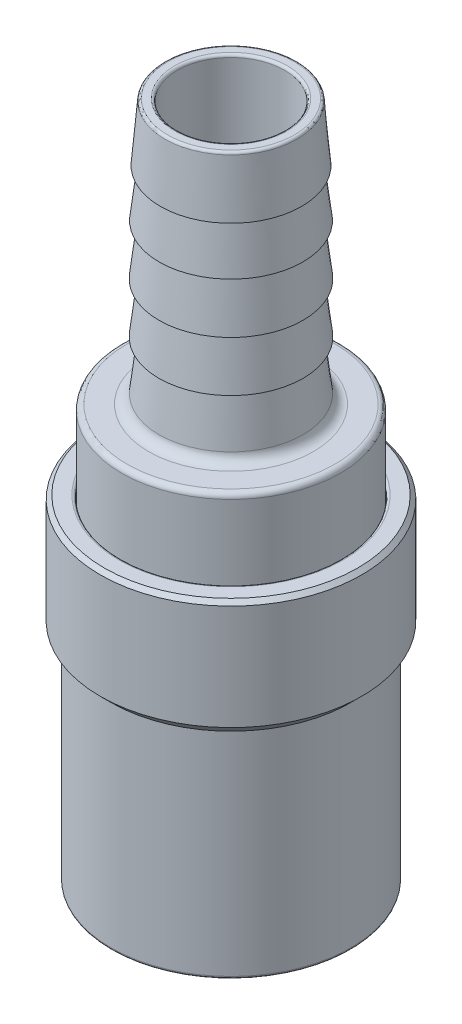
ISO-10303-21;
HEADER;
FILE_DESCRIPTION(('STEP AP214'),'2;1');
FILE_NAME('part.step','',(''),(''),'','','');
FILE_SCHEMA(('AUTOMOTIVE_DESIGN { 1 0 10303 214 1 1 1 1 }'));
ENDSEC;
DATA;
#1=APPLICATION_CONTEXT('core data for automotive mechanical design processes');
#2=APPLICATION_PROTOCOL_DEFINITION('international standard','automotive_design',2000,#1);
#3=PRODUCT_CONTEXT('',#1,'mechanical');
#4=PRODUCT('Part','Part','',(#3));
#5=PRODUCT_RELATED_PRODUCT_CATEGORY('part','',(#4));
#6=PRODUCT_DEFINITION_FORMATION('','',#4);
#7=PRODUCT_DEFINITION_CONTEXT('part definition',#1,'design');
#8=PRODUCT_DEFINITION('design','',#6,#7);
#9=PRODUCT_DEFINITION_SHAPE('','',#8);
#10=(LENGTH_UNIT() NAMED_UNIT(*) SI_UNIT(.MILLI.,.METRE.));
#11=(NAMED_UNIT(*) PLANE_ANGLE_UNIT() SI_UNIT($,.RADIAN.));
#12=(NAMED_UNIT(*) SI_UNIT($,.STERADIAN.) SOLID_ANGLE_UNIT());
#13=UNCERTAINTY_MEASURE_WITH_UNIT(LENGTH_MEASURE(1.E-05),#10,'distance_accuracy_value','');
#14=(GEOMETRIC_REPRESENTATION_CONTEXT(3) GLOBAL_UNCERTAINTY_ASSIGNED_CONTEXT((#13)) GLOBAL_UNIT_ASSIGNED_CONTEXT((#10,
#11,#12)) REPRESENTATION_CONTEXT('',''));
#15=CARTESIAN_POINT('',(0.,0.,0.));
#16=DIRECTION('',(0.,0.,1.));
#17=DIRECTION('',(1.,0.,0.));
#18=AXIS2_PLACEMENT_3D('',#15,#16,#17);
#19=CARTESIAN_POINT('',(0.,64.8208,0.));
#20=DIRECTION('',(0.,1.,0.));
#21=DIRECTION('',(0.,0.,1.));
#22=AXIS2_PLACEMENT_3D('',#19,#20,#21);
#23=TOROIDAL_SURFACE('',#22,5.4102,0.254);
#24=CARTESIAN_POINT('',(0.,64.8208,0.));
#25=DIRECTION('',(0.,-1.,0.));
#26=DIRECTION('',(1.,0.,0.));
#27=AXIS2_PLACEMENT_3D('',#24,#25,#26);
#28=CIRCLE('',#27,5.1562);
#29=CARTESIAN_POINT('',(-5.1562,64.8208,0.));
#30=VERTEX_POINT('',#29);
#31=CARTESIAN_POINT('',(0.,64.8208,-5.1562));
#32=VERTEX_POINT('',#31);
#33=EDGE_CURVE('P0_E11',#30,#32,#28,.T.);
#34=ORIENTED_EDGE('',*,*,#33,.T.);
#35=CARTESIAN_POINT('',(0.,64.8208,-5.4102));
#36=DIRECTION('',(-1.,0.,0.));
#37=DIRECTION('',(0.,0.,-1.));
#38=AXIS2_PLACEMENT_3D('',#35,#36,#37);
#39=CIRCLE('',#38,0.254);
#40=CARTESIAN_POINT('',(0.,65.0748,-5.4102));
#41=VERTEX_POINT('',#40);
#42=EDGE_CURVE('P0_E27',#32,#41,#39,.T.);
#43=ORIENTED_EDGE('',*,*,#42,.T.);
#44=CARTESIAN_POINT('',(0.,65.0748,0.));
#45=DIRECTION('',(0.,1.,0.));
#46=DIRECTION('',(1.,0.,0.));
#47=AXIS2_PLACEMENT_3D('',#44,#45,#46);
#48=CIRCLE('',#47,5.4102);
#49=CARTESIAN_POINT('',(-5.4102,65.0748,0.));
#50=VERTEX_POINT('',#49);
#51=EDGE_CURVE('P0_E310',#41,#50,#48,.T.);
#52=ORIENTED_EDGE('',*,*,#51,.T.);
#53=CARTESIAN_POINT('',(0.,65.0748,0.));
#54=DIRECTION('',(0.,1.,0.));
#55=DIRECTION('',(1.,0.,0.));
#56=AXIS2_PLACEMENT_3D('',#53,#54,#55);
#57=CIRCLE('',#56,5.4102);
#58=EDGE_CURVE('P0_E391',#50,#41,#57,.T.);
#59=ORIENTED_EDGE('',*,*,#58,.T.);
#60=ORIENTED_EDGE('',*,*,#42,.F.);
#61=CARTESIAN_POINT('',(0.,64.8208,0.));
#62=DIRECTION('',(0.,-1.,0.));
#63=DIRECTION('',(1.,0.,0.));
#64=AXIS2_PLACEMENT_3D('',#61,#62,#63);
#65=CIRCLE('',#64,5.1562);
#66=CARTESIAN_POINT('',(5.1562,64.8208,0.));
#67=VERTEX_POINT('',#66);
#68=EDGE_CURVE('P0_E394',#32,#67,#65,.T.);
#69=ORIENTED_EDGE('',*,*,#68,.T.);
#70=CARTESIAN_POINT('',(0.,64.8208,0.));
#71=DIRECTION('',(0.,-1.,0.));
#72=DIRECTION('',(1.,0.,0.));
#73=AXIS2_PLACEMENT_3D('',#70,#71,#72);
#74=CIRCLE('',#73,5.1562);
#75=EDGE_CURVE('P0_E416',#67,#30,#74,.T.);
#76=ORIENTED_EDGE('',*,*,#75,.T.);
#77=EDGE_LOOP('',(#34,#43,#52,#59,#60,#69,#76));
#78=FACE_BOUND('',#77,.T.);
#79=ADVANCED_FACE('P0_F16',(#78),#23,.T.);
#80=CARTESIAN_POINT('',(-5.1562,65.0748,0.));
#81=DIRECTION('',(0.,1.,0.));
#82=DIRECTION('',(1.,0.,0.));
#83=AXIS2_PLACEMENT_3D('',#80,#81,#82);
#84=PLANE('',#83);
#85=CARTESIAN_POINT('',(0.,65.0748,0.));
#86=DIRECTION('',(0.,-1.,0.));
#87=DIRECTION('',(1.,0.,0.));
#88=AXIS2_PLACEMENT_3D('',#85,#86,#87);
#89=CIRCLE('',#88,6.08023053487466);
#90=CARTESIAN_POINT('',(-6.08023053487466,65.0748,0.));
#91=VERTEX_POINT('',#90);
#92=CARTESIAN_POINT('',(0.,65.0748,-6.08023053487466));
#93=VERTEX_POINT('',#92);
#94=EDGE_CURVE('P0_E269',#91,#93,#89,.T.);
#95=ORIENTED_EDGE('',*,*,#94,.F.);
#96=CARTESIAN_POINT('',(0.,65.0748,0.));
#97=DIRECTION('',(0.,-1.,0.));
#98=DIRECTION('',(1.,0.,0.));
#99=AXIS2_PLACEMENT_3D('',#96,#97,#98);
#100=CIRCLE('',#99,6.08023053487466);
#101=EDGE_CURVE('P0_E265',#93,#91,#100,.T.);
#102=ORIENTED_EDGE('',*,*,#101,.F.);
#103=EDGE_LOOP('',(#95,#102));
#104=FACE_BOUND('',#103,.T.);
#105=ORIENTED_EDGE('',*,*,#58,.F.);
#106=ORIENTED_EDGE('',*,*,#51,.F.);
#107=EDGE_LOOP('',(#105,#106));
#108=FACE_BOUND('',#107,.T.);
#109=ADVANCED_FACE('P0_F267',(#104,#108),#84,.T.);
#110=CARTESIAN_POINT('',(0.,42.5308048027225,0.));
#111=DIRECTION('',(0.,1.,0.));
#112=DIRECTION('',(-1.,0.,0.));
#113=AXIS2_PLACEMENT_3D('',#110,#111,#112);
#114=CYLINDRICAL_SURFACE('',#113,5.1562);
#115=ORIENTED_EDGE('',*,*,#33,.F.);
#116=ORIENTED_EDGE('',*,*,#75,.F.);
#117=DIRECTION('',(0.,-1.,0.));
#118=VECTOR('',#117,1.);
#119=CARTESIAN_POINT('',(5.1562,42.5308048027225,0.));
#120=LINE('',#119,#118);
#121=CARTESIAN_POINT('',(5.1562,19.9868096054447,0.));
#122=VERTEX_POINT('',#121);
#123=EDGE_CURVE('P0_E281',#67,#122,#120,.T.);
#124=ORIENTED_EDGE('',*,*,#123,.T.);
#125=CARTESIAN_POINT('',(0.,19.9868096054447,0.));
#126=DIRECTION('',(0.,1.,0.));
#127=DIRECTION('',(0.,0.,1.));
#128=AXIS2_PLACEMENT_3D('',#125,#126,#127);
#129=CIRCLE('',#128,5.1562);
#130=CARTESIAN_POINT('',(-5.1562,19.9868096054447,0.));
#131=VERTEX_POINT('',#130);
#132=EDGE_CURVE('P0_E469',#131,#122,#129,.T.);
#133=ORIENTED_EDGE('',*,*,#132,.F.);
#134=CARTESIAN_POINT('',(0.,19.9868096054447,0.));
#135=DIRECTION('',(0.,1.,0.));
#136=DIRECTION('',(0.,0.,1.));
#137=AXIS2_PLACEMENT_3D('',#134,#135,#136);
#138=CIRCLE('',#137,5.1562);
#139=EDGE_CURVE('P0_E476',#122,#131,#138,.T.);
#140=ORIENTED_EDGE('',*,*,#139,.F.);
#141=ORIENTED_EDGE('',*,*,#123,.F.);
#142=ORIENTED_EDGE('',*,*,#68,.F.);
#143=EDGE_LOOP('',(#115,#116,#124,#133,#140,#141,#142));
#144=FACE_BOUND('',#143,.T.);
#145=ADVANCED_FACE('P0_F597',(#144),#114,.F.);
#146=CARTESIAN_POINT('',(0.,64.8208,0.));
#147=DIRECTION('',(0.,1.,0.));
#148=DIRECTION('',(0.,0.,1.));
#149=AXIS2_PLACEMENT_3D('',#146,#147,#148);
#150=TOROIDAL_SURFACE('',#149,6.08023053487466,0.254);
#151=ORIENTED_EDGE('',*,*,#94,.T.);
#152=CARTESIAN_POINT('',(0.,64.8208,-6.08023053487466));
#153=DIRECTION('',(-1.,0.,0.));
#154=DIRECTION('',(0.,0.,-1.));
#155=AXIS2_PLACEMENT_3D('',#152,#153,#154);
#156=CIRCLE('',#155,0.254);
#157=CARTESIAN_POINT('',(0.,64.8419963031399,-6.3333445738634));
#158=VERTEX_POINT('',#157);
#159=EDGE_CURVE('P0_E278',#93,#158,#156,.T.);
#160=ORIENTED_EDGE('',*,*,#159,.T.);
#161=CARTESIAN_POINT('',(0.,64.8419963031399,0.));
#162=DIRECTION('',(0.,1.,0.));
#163=DIRECTION('',(1.,0.,0.));
#164=AXIS2_PLACEMENT_3D('',#161,#162,#163);
#165=CIRCLE('',#164,6.3333445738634);
#166=CARTESIAN_POINT('',(-6.3333445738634,64.8419963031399,0.));
#167=VERTEX_POINT('',#166);
#168=EDGE_CURVE('P0_E285',#158,#167,#165,.T.);
#169=ORIENTED_EDGE('',*,*,#168,.T.);
#170=CARTESIAN_POINT('',(0.,64.8419963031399,0.));
#171=DIRECTION('',(0.,1.,0.));
#172=DIRECTION('',(1.,0.,0.));
#173=AXIS2_PLACEMENT_3D('',#170,#171,#172);
#174=CIRCLE('',#173,6.3333445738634);
#175=CARTESIAN_POINT('',(6.3333445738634,64.8419963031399,0.));
#176=VERTEX_POINT('',#175);
#177=EDGE_CURVE('P0_E291',#167,#176,#174,.T.);
#178=ORIENTED_EDGE('',*,*,#177,.T.);
#179=CARTESIAN_POINT('',(0.,64.8419963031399,0.));
#180=DIRECTION('',(0.,1.,0.));
#181=DIRECTION('',(1.,0.,0.));
#182=AXIS2_PLACEMENT_3D('',#179,#180,#181);
#183=CIRCLE('',#182,6.3333445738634);
#184=EDGE_CURVE('P0_E273',#176,#158,#183,.T.);
#185=ORIENTED_EDGE('',*,*,#184,.T.);
#186=ORIENTED_EDGE('',*,*,#159,.F.);
#187=ORIENTED_EDGE('',*,*,#101,.T.);
#188=EDGE_LOOP('',(#151,#160,#169,#178,#185,#186,#187));
#189=FACE_BOUND('',#188,.T.);
#190=ADVANCED_FACE('P0_F277',(#189),#150,.T.);
#191=CARTESIAN_POINT('',(0.,62.2808,0.));
#192=DIRECTION('',(0.,-1.,0.));
#193=DIRECTION('',(-1.,0.,0.));
#194=AXIS2_PLACEMENT_3D('',#191,#192,#193);
#195=CONICAL_SURFACE('',#194,6.54782455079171,0.0835471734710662);
#196=ORIENTED_EDGE('',*,*,#177,.F.);
#197=ORIENTED_EDGE('',*,*,#168,.F.);
#198=ORIENTED_EDGE('',*,*,#184,.F.);
#199=DIRECTION('',(0.0834500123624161,-0.99651196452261,0.));
#200=VECTOR('',#199,1.);
#201=CARTESIAN_POINT('',(6.54782455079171,62.2808,0.));
#202=LINE('',#201,#200);
#203=CARTESIAN_POINT('',(6.7818,59.4868,0.));
#204=VERTEX_POINT('',#203);
#205=EDGE_CURVE('P0_E274',#176,#204,#202,.T.);
#206=ORIENTED_EDGE('',*,*,#205,.T.);
#207=CARTESIAN_POINT('',(0.,59.4868,0.));
#208=DIRECTION('',(0.,1.,0.));
#209=DIRECTION('',(0.,0.,1.));
#210=AXIS2_PLACEMENT_3D('',#207,#208,#209);
#211=CIRCLE('',#210,6.7818);
#212=CARTESIAN_POINT('',(-6.7818,59.4868,0.));
#213=VERTEX_POINT('',#212);
#214=EDGE_CURVE('P0_E465',#204,#213,#211,.T.);
#215=ORIENTED_EDGE('',*,*,#214,.T.);
#216=CARTESIAN_POINT('',(0.,59.4868,0.));
#217=DIRECTION('',(0.,1.,0.));
#218=DIRECTION('',(0.,0.,1.));
#219=AXIS2_PLACEMENT_3D('',#216,#217,#218);
#220=CIRCLE('',#219,6.7818);
#221=EDGE_CURVE('P0_E507',#213,#204,#220,.T.);
#222=ORIENTED_EDGE('',*,*,#221,.T.);
#223=ORIENTED_EDGE('',*,*,#205,.F.);
#224=EDGE_LOOP('',(#196,#197,#198,#206,#215,#222,#223));
#225=FACE_BOUND('',#224,.T.);
#226=ADVANCED_FACE('P0_F621',(#225),#195,.T.);
#227=CARTESIAN_POINT('',(0.,40.6908,0.));
#228=DIRECTION('',(0.,1.,0.));
#229=DIRECTION('',(0.,0.,1.));
#230=AXIS2_PLACEMENT_3D('',#227,#228,#229);
#231=TOROIDAL_SURFACE('',#230,7.9062910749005,1.016);
#232=CARTESIAN_POINT('',(0.,39.6748,0.));
#233=DIRECTION('',(0.,1.,0.));
#234=DIRECTION('',(1.,0.,0.));
#235=AXIS2_PLACEMENT_3D('',#232,#233,#234);
#236=CIRCLE('',#235,7.9062910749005);
#237=CARTESIAN_POINT('',(-7.9062910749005,39.6748,0.));
#238=VERTEX_POINT('',#237);
#239=CARTESIAN_POINT('',(0.,39.6748,-7.9062910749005));
#240=VERTEX_POINT('',#239);
#241=EDGE_CURVE('P0_E347',#238,#240,#236,.T.);
#242=ORIENTED_EDGE('',*,*,#241,.T.);
#243=CARTESIAN_POINT('',(0.,40.6908,-7.9062910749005));
#244=DIRECTION('',(-1.,0.,0.));
#245=DIRECTION('',(0.,0.,-1.));
#246=AXIS2_PLACEMENT_3D('',#243,#244,#245);
#247=CIRCLE('',#246,1.016);
#248=CARTESIAN_POINT('',(0.,40.5730652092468,-6.89713572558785));
#249=VERTEX_POINT('',#248);
#250=EDGE_CURVE('P0_E344',#240,#249,#247,.T.);
#251=ORIENTED_EDGE('',*,*,#250,.T.);
#252=CARTESIAN_POINT('',(0.,40.5730652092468,0.));
#253=DIRECTION('',(0.,-1.,0.));
#254=DIRECTION('',(1.,0.,0.));
#255=AXIS2_PLACEMENT_3D('',#252,#253,#254);
#256=CIRCLE('',#255,6.89713572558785);
#257=CARTESIAN_POINT('',(6.89713572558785,40.5730652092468,0.));
#258=VERTEX_POINT('',#257);
#259=EDGE_CURVE('P0_E348',#249,#258,#256,.T.);
#260=ORIENTED_EDGE('',*,*,#259,.T.);
#261=CARTESIAN_POINT('',(0.,40.5730652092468,0.));
#262=DIRECTION('',(0.,-1.,0.));
#263=DIRECTION('',(1.,0.,0.));
#264=AXIS2_PLACEMENT_3D('',#261,#262,#263);
#265=CIRCLE('',#264,6.89713572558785);
#266=CARTESIAN_POINT('',(-6.89713572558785,40.5730652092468,0.));
#267=VERTEX_POINT('',#266);
#268=EDGE_CURVE('P0_E362',#258,#267,#265,.T.);
#269=ORIENTED_EDGE('',*,*,#268,.T.);
#270=CARTESIAN_POINT('',(0.,40.5730652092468,0.));
#271=DIRECTION('',(0.,-1.,0.));
#272=DIRECTION('',(1.,0.,0.));
#273=AXIS2_PLACEMENT_3D('',#270,#271,#272);
#274=CIRCLE('',#273,6.89713572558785);
#275=EDGE_CURVE('P0_E365',#267,#249,#274,.T.);
#276=ORIENTED_EDGE('',*,*,#275,.T.);
#277=ORIENTED_EDGE('',*,*,#250,.F.);
#278=CARTESIAN_POINT('',(0.,39.6748,0.));
#279=DIRECTION('',(0.,1.,0.));
#280=DIRECTION('',(1.,0.,0.));
#281=AXIS2_PLACEMENT_3D('',#278,#279,#280);
#282=CIRCLE('',#281,7.9062910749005);
#283=EDGE_CURVE('P0_E20',#240,#238,#282,.T.);
#284=ORIENTED_EDGE('',*,*,#283,.T.);
#285=EDGE_LOOP('',(#242,#251,#260,#269,#276,#277,#284));
#286=FACE_BOUND('',#285,.T.);
#287=ADVANCED_FACE('P0_F684',(#286),#231,.F.);
#288=CARTESIAN_POINT('',(-7.00193333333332,39.6748,0.));
#289=DIRECTION('',(0.,1.,0.));
#290=DIRECTION('',(1.,0.,0.));
#291=AXIS2_PLACEMENT_3D('',#288,#289,#290);
#292=PLANE('',#291);
#293=CARTESIAN_POINT('',(0.,39.6748,0.));
#294=DIRECTION('',(0.,-1.,0.));
#295=DIRECTION('',(1.,0.,0.));
#296=AXIS2_PLACEMENT_3D('',#293,#294,#295);
#297=CIRCLE('',#296,9.9822);
#298=CARTESIAN_POINT('',(-9.9822,39.6748,0.));
#299=VERTEX_POINT('',#298);
#300=CARTESIAN_POINT('',(0.,39.6748,-9.9822));
#301=VERTEX_POINT('',#300);
#302=EDGE_CURVE('P0_E493',#299,#301,#297,.T.);
#303=ORIENTED_EDGE('',*,*,#302,.F.);
#304=CARTESIAN_POINT('',(0.,39.6748,0.));
#305=DIRECTION('',(0.,-1.,0.));
#306=DIRECTION('',(1.,0.,0.));
#307=AXIS2_PLACEMENT_3D('',#304,#305,#306);
#308=CIRCLE('',#307,9.9822);
#309=EDGE_CURVE('P0_E451',#301,#299,#308,.T.);
#310=ORIENTED_EDGE('',*,*,#309,.F.);
#311=EDGE_LOOP('',(#303,#310));
#312=FACE_BOUND('',#311,.T.);
#313=ORIENTED_EDGE('',*,*,#241,.F.);
#314=ORIENTED_EDGE('',*,*,#283,.F.);
#315=EDGE_LOOP('',(#313,#314));
#316=FACE_BOUND('',#315,.T.);
#317=ADVANCED_FACE('P0_F617',(#312,#316),#292,.T.);
#318=CARTESIAN_POINT('',(0.,42.4688,0.));
#319=DIRECTION('',(0.,-1.,0.));
#320=DIRECTION('',(-1.,0.,0.));
#321=AXIS2_PLACEMENT_3D('',#318,#319,#320);
#322=CONICAL_SURFACE('',#321,6.67596666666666,0.116141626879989);
#323=CARTESIAN_POINT('',(0.,45.2628,0.));
#324=DIRECTION('',(0.,1.,0.));
#325=DIRECTION('',(0.,0.,1.));
#326=AXIS2_PLACEMENT_3D('',#323,#324,#325);
#327=CIRCLE('',#326,6.35);
#328=CARTESIAN_POINT('',(-6.35,45.2628,0.));
#329=VERTEX_POINT('',#328);
#330=CARTESIAN_POINT('',(6.35,45.2628,0.));
#331=VERTEX_POINT('',#330);
#332=EDGE_CURVE('P0_E376',#329,#331,#327,.T.);
#333=ORIENTED_EDGE('',*,*,#332,.F.);
#334=CARTESIAN_POINT('',(0.,45.2628,0.));
#335=DIRECTION('',(0.,1.,0.));
#336=DIRECTION('',(0.,0.,1.));
#337=AXIS2_PLACEMENT_3D('',#334,#335,#336);
#338=CIRCLE('',#337,6.35);
#339=EDGE_CURVE('P0_E372',#331,#329,#338,.T.);
#340=ORIENTED_EDGE('',*,*,#339,.F.);
#341=DIRECTION('',(0.115880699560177,-0.993263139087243,0.));
#342=VECTOR('',#341,1.);
#343=CARTESIAN_POINT('',(6.67596666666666,42.4688,0.));
#344=LINE('',#343,#342);
#345=EDGE_CURVE('P0_E489',#331,#258,#344,.T.);
#346=ORIENTED_EDGE('',*,*,#345,.T.);
#347=ORIENTED_EDGE('',*,*,#259,.F.);
#348=ORIENTED_EDGE('',*,*,#275,.F.);
#349=ORIENTED_EDGE('',*,*,#268,.F.);
#350=ORIENTED_EDGE('',*,*,#345,.F.);
#351=EDGE_LOOP('',(#333,#340,#346,#347,#348,#349,#350));
#352=FACE_BOUND('',#351,.T.);
#353=ADVANCED_FACE('P0_F614',(#352),#322,.T.);
#354=CARTESIAN_POINT('',(0.,39.1668,0.));
#355=DIRECTION('',(0.,1.,0.));
#356=DIRECTION('',(0.,0.,1.));
#357=AXIS2_PLACEMENT_3D('',#354,#355,#356);
#358=TOROIDAL_SURFACE('',#357,9.9822,0.508);
#359=ORIENTED_EDGE('',*,*,#302,.T.);
#360=CARTESIAN_POINT('',(0.,39.1668,-9.9822));
#361=DIRECTION('',(-1.,0.,0.));
#362=DIRECTION('',(0.,0.,-1.));
#363=AXIS2_PLACEMENT_3D('',#360,#361,#362);
#364=CIRCLE('',#363,0.508);
#365=CARTESIAN_POINT('',(0.,39.1668,-10.4902));
#366=VERTEX_POINT('',#365);
#367=EDGE_CURVE('P0_E503',#301,#366,#364,.T.);
#368=ORIENTED_EDGE('',*,*,#367,.T.);
#369=CARTESIAN_POINT('',(0.,39.1668,0.));
#370=DIRECTION('',(0.,1.,0.));
#371=DIRECTION('',(1.,0.,0.));
#372=AXIS2_PLACEMENT_3D('',#369,#370,#371);
#373=CIRCLE('',#372,10.4902);
#374=CARTESIAN_POINT('',(-10.4902,39.1668,0.));
#375=VERTEX_POINT('',#374);
#376=EDGE_CURVE('P0_E500',#366,#375,#373,.T.);
#377=ORIENTED_EDGE('',*,*,#376,.T.);
#378=CARTESIAN_POINT('',(0.,39.1668,0.));
#379=DIRECTION('',(0.,1.,0.));
#380=DIRECTION('',(1.,0.,0.));
#381=AXIS2_PLACEMENT_3D('',#378,#379,#380);
#382=CIRCLE('',#381,10.4902);
#383=CARTESIAN_POINT('',(10.4902,39.1668,0.));
#384=VERTEX_POINT('',#383);
#385=EDGE_CURVE('P0_E461',#375,#384,#382,.T.);
#386=ORIENTED_EDGE('',*,*,#385,.T.);
#387=CARTESIAN_POINT('',(0.,39.1668,0.));
#388=DIRECTION('',(0.,1.,0.));
#389=DIRECTION('',(1.,0.,0.));
#390=AXIS2_PLACEMENT_3D('',#387,#388,#389);
#391=CIRCLE('',#390,10.4902);
#392=EDGE_CURVE('P0_E457',#384,#366,#391,.T.);
#393=ORIENTED_EDGE('',*,*,#392,.T.);
#394=ORIENTED_EDGE('',*,*,#367,.F.);
#395=ORIENTED_EDGE('',*,*,#309,.T.);
#396=EDGE_LOOP('',(#359,#368,#377,#386,#393,#394,#395));
#397=FACE_BOUND('',#396,.T.);
#398=ADVANCED_FACE('P0_F559',(#397),#358,.T.);
#399=CARTESIAN_POINT('',(0.,28.7274,0.));
#400=DIRECTION('',(0.,1.,0.));
#401=DIRECTION('',(-1.,0.,0.));
#402=AXIS2_PLACEMENT_3D('',#399,#400,#401);
#403=CYLINDRICAL_SURFACE('',#402,10.4902);
#404=ORIENTED_EDGE('',*,*,#385,.F.);
#405=ORIENTED_EDGE('',*,*,#376,.F.);
#406=ORIENTED_EDGE('',*,*,#392,.F.);
#407=DIRECTION('',(0.,-1.,0.));
#408=VECTOR('',#407,1.);
#409=CARTESIAN_POINT('',(10.4902,28.7274,0.));
#410=LINE('',#409,#408);
#411=CARTESIAN_POINT('',(10.4902,17.78,0.));
#412=VERTEX_POINT('',#411);
#413=EDGE_CURVE('P0_E300',#384,#412,#410,.T.);
#414=ORIENTED_EDGE('',*,*,#413,.T.);
#415=CARTESIAN_POINT('',(0.,17.78,0.));
#416=DIRECTION('',(0.,1.,0.));
#417=DIRECTION('',(0.,0.,1.));
#418=AXIS2_PLACEMENT_3D('',#415,#416,#417);
#419=CIRCLE('',#418,10.4902);
#420=CARTESIAN_POINT('',(-10.4902,17.78,0.));
#421=VERTEX_POINT('',#420);
#422=EDGE_CURVE('P0_E297',#412,#421,#419,.T.);
#423=ORIENTED_EDGE('',*,*,#422,.T.);
#424=CARTESIAN_POINT('',(0.,17.78,0.));
#425=DIRECTION('',(0.,1.,0.));
#426=DIRECTION('',(0.,0.,1.));
#427=AXIS2_PLACEMENT_3D('',#424,#425,#426);
#428=CIRCLE('',#427,10.4902);
#429=EDGE_CURVE('P0_E301',#421,#412,#428,.T.);
#430=ORIENTED_EDGE('',*,*,#429,.T.);
#431=ORIENTED_EDGE('',*,*,#413,.F.);
#432=EDGE_LOOP('',(#404,#405,#406,#414,#423,#430,#431));
#433=FACE_BOUND('',#432,.T.);
#434=ADVANCED_FACE('P0_F18',(#433),#403,.T.);
#435=CARTESIAN_POINT('',(0.,0.508,0.));
#436=DIRECTION('',(0.,-1.,0.));
#437=DIRECTION('',(1.,0.,0.));
#438=AXIS2_PLACEMENT_3D('',#435,#436,#437);
#439=CONICAL_SURFACE('',#438,7.2517,0.785398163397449);
#440=CARTESIAN_POINT('',(0.,0.,0.));
#441=DIRECTION('',(0.,-1.,0.));
#442=DIRECTION('',(1.,0.,0.));
#443=AXIS2_PLACEMENT_3D('',#440,#441,#442);
#444=CIRCLE('',#443,7.7597);
#445=CARTESIAN_POINT('',(-7.7597,0.,0.));
#446=VERTEX_POINT('',#445);
#447=EDGE_CURVE('P0_E326',#446,#446,#444,.T.);
#448=ORIENTED_EDGE('',*,*,#447,.T.);
#449=DIRECTION('',(0.707106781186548,0.707106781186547,0.));
#450=VECTOR('',#449,1.);
#451=CARTESIAN_POINT('',(-7.2517,0.508,0.));
#452=LINE('',#451,#450);
#453=CARTESIAN_POINT('',(-6.7437,1.016,0.));
#454=VERTEX_POINT('',#453);
#455=EDGE_CURVE('P0_E354',#446,#454,#452,.T.);
#456=ORIENTED_EDGE('',*,*,#455,.T.);
#457=CARTESIAN_POINT('',(0.,1.016,0.));
#458=DIRECTION('',(0.,1.,0.));
#459=DIRECTION('',(1.,0.,0.));
#460=AXIS2_PLACEMENT_3D('',#457,#458,#459);
#461=CIRCLE('',#460,6.7437);
#462=CARTESIAN_POINT('',(6.7437,1.016,0.));
#463=VERTEX_POINT('',#462);
#464=EDGE_CURVE('P0_E350',#454,#463,#461,.T.);
#465=ORIENTED_EDGE('',*,*,#464,.T.);
#466=CARTESIAN_POINT('',(0.,1.016,0.));
#467=DIRECTION('',(0.,1.,0.));
#468=DIRECTION('',(1.,0.,0.));
#469=AXIS2_PLACEMENT_3D('',#466,#467,#468);
#470=CIRCLE('',#469,6.7437);
#471=EDGE_CURVE('P0_E355',#463,#454,#470,.T.);
#472=ORIENTED_EDGE('',*,*,#471,.T.);
#473=ORIENTED_EDGE('',*,*,#455,.F.);
#474=EDGE_LOOP('',(#448,#456,#465,#472,#473));
#475=FACE_BOUND('',#474,.T.);
#476=ADVANCED_FACE('P0_F537',(#475),#439,.F.);
#477=CARTESIAN_POINT('',(0.,6.5396999,0.));
#478=DIRECTION('',(0.,1.,0.));
#479=DIRECTION('',(-1.,0.,0.));
#480=AXIS2_PLACEMENT_3D('',#477,#478,#479);
#481=CYLINDRICAL_SURFACE('',#480,6.7437);
#482=CARTESIAN_POINT('',(0.,13.0793998,0.));
#483=DIRECTION('',(0.,1.,0.));
#484=DIRECTION('',(0.,0.,1.));
#485=AXIS2_PLACEMENT_3D('',#482,#483,#484);
#486=CIRCLE('',#485,6.7437);
#487=CARTESIAN_POINT('',(-6.7437,13.0793998,0.));
#488=VERTEX_POINT('',#487);
#489=CARTESIAN_POINT('',(6.7437,13.0793998,0.));
#490=VERTEX_POINT('',#489);
#491=EDGE_CURVE('P0_E331',#488,#490,#486,.T.);
#492=ORIENTED_EDGE('',*,*,#491,.T.);
#493=DIRECTION('',(0.,-1.,0.));
#494=VECTOR('',#493,1.);
#495=CARTESIAN_POINT('',(6.7437,6.5396999,0.));
#496=LINE('',#495,#494);
#497=EDGE_CURVE('P0_E327',#490,#463,#496,.T.);
#498=ORIENTED_EDGE('',*,*,#497,.T.);
#499=ORIENTED_EDGE('',*,*,#464,.F.);
#500=ORIENTED_EDGE('',*,*,#471,.F.);
#501=ORIENTED_EDGE('',*,*,#497,.F.);
#502=CARTESIAN_POINT('',(0.,13.0793998,0.));
#503=DIRECTION('',(0.,1.,0.));
#504=DIRECTION('',(0.,0.,1.));
#505=AXIS2_PLACEMENT_3D('',#502,#503,#504);
#506=CIRCLE('',#505,6.7437);
#507=EDGE_CURVE('P0_E332',#490,#488,#506,.T.);
#508=ORIENTED_EDGE('',*,*,#507,.T.);
#509=EDGE_LOOP('',(#492,#498,#499,#500,#501,#508));
#510=FACE_BOUND('',#509,.T.);
#511=ADVANCED_FACE('P0_F540',(#510),#481,.F.);
#512=CARTESIAN_POINT('',(-8.9535,0.,0.));
#513=DIRECTION('',(0.,-1.,0.));
#514=DIRECTION('',(0.,0.,-1.));
#515=AXIS2_PLACEMENT_3D('',#512,#513,#514);
#516=PLANE('',#515);
#517=CARTESIAN_POINT('',(0.,0.,0.));
#518=DIRECTION('',(0.,1.,0.));
#519=DIRECTION('',(0.,0.,1.));
#520=AXIS2_PLACEMENT_3D('',#517,#518,#519);
#521=CIRCLE('',#520,8.9535);
#522=CARTESIAN_POINT('',(-8.9535,0.,0.));
#523=VERTEX_POINT('',#522);
#524=CARTESIAN_POINT('',(8.9535,0.,0.));
#525=VERTEX_POINT('',#524);
#526=EDGE_CURVE('P0_E338',#523,#525,#521,.T.);
#527=ORIENTED_EDGE('',*,*,#526,.F.);
#528=CARTESIAN_POINT('',(0.,0.,0.));
#529=DIRECTION('',(0.,1.,0.));
#530=DIRECTION('',(0.,0.,1.));
#531=AXIS2_PLACEMENT_3D('',#528,#529,#530);
#532=CIRCLE('',#531,8.9535);
#533=EDGE_CURVE('P0_E333',#525,#523,#532,.T.);
#534=ORIENTED_EDGE('',*,*,#533,.F.);
#535=EDGE_LOOP('',(#527,#534));
#536=FACE_BOUND('',#535,.T.);
#537=ORIENTED_EDGE('',*,*,#447,.F.);
#538=EDGE_LOOP('',(#537));
#539=FACE_BOUND('',#538,.T.);
#540=ADVANCED_FACE('P0_F577',(#536,#539),#516,.T.);
#541=CARTESIAN_POINT('',(-7.12675285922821,19.9868096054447,0.));
#542=DIRECTION('',(0.,-1.,0.));
#543=DIRECTION('',(0.,0.,-1.));
#544=AXIS2_PLACEMENT_3D('',#541,#542,#543);
#545=PLANE('',#544);
#546=CARTESIAN_POINT('',(0.,19.9868096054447,0.));
#547=DIRECTION('',(0.,1.,0.));
#548=DIRECTION('',(0.,0.,1.));
#549=AXIS2_PLACEMENT_3D('',#546,#547,#548);
#550=CIRCLE('',#549,7.12675285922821);
#551=CARTESIAN_POINT('',(-7.12675285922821,19.9868096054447,0.));
#552=VERTEX_POINT('',#551);
#553=CARTESIAN_POINT('',(7.12675285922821,19.9868096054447,0.));
#554=VERTEX_POINT('',#553);
#555=EDGE_CURVE('P0_E399',#552,#554,#550,.T.);
#556=ORIENTED_EDGE('',*,*,#555,.F.);
#557=CARTESIAN_POINT('',(0.,19.9868096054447,0.));
#558=DIRECTION('',(0.,1.,0.));
#559=DIRECTION('',(0.,0.,1.));
#560=AXIS2_PLACEMENT_3D('',#557,#558,#559);
#561=CIRCLE('',#560,7.12675285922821);
#562=EDGE_CURVE('P0_E400',#554,#552,#561,.T.);
#563=ORIENTED_EDGE('',*,*,#562,.F.);
#564=EDGE_LOOP('',(#556,#563));
#565=FACE_BOUND('',#564,.T.);
#566=ORIENTED_EDGE('',*,*,#132,.T.);
#567=ORIENTED_EDGE('',*,*,#139,.T.);
#568=EDGE_LOOP('',(#566,#567));
#569=FACE_BOUND('',#568,.T.);
#570=ADVANCED_FACE('P0_F579',(#565,#569),#545,.T.);
#571=CARTESIAN_POINT('',(0.,18.9252928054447,0.));
#572=DIRECTION('',(0.,1.,0.));
#573=DIRECTION('',(-1.,0.,0.));
#574=AXIS2_PLACEMENT_3D('',#571,#572,#573);
#575=CYLINDRICAL_SURFACE('',#574,7.12675285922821);
#576=ORIENTED_EDGE('',*,*,#555,.T.);
#577=DIRECTION('',(0.,-1.,0.));
#578=VECTOR('',#577,1.);
#579=CARTESIAN_POINT('',(7.12675285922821,18.9252928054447,0.));
#580=LINE('',#579,#578);
#581=CARTESIAN_POINT('',(7.12675285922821,17.8637760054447,0.));
#582=VERTEX_POINT('',#581);
#583=EDGE_CURVE('P0_E395',#554,#582,#580,.T.);
#584=ORIENTED_EDGE('',*,*,#583,.T.);
#585=CARTESIAN_POINT('',(0.,17.8637760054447,0.));
#586=DIRECTION('',(0.,1.,0.));
#587=DIRECTION('',(0.,0.,1.));
#588=AXIS2_PLACEMENT_3D('',#585,#586,#587);
#589=CIRCLE('',#588,7.12675285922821);
#590=CARTESIAN_POINT('',(-7.12675285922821,17.8637760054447,0.));
#591=VERTEX_POINT('',#590);
#592=EDGE_CURVE('P0_E430',#591,#582,#589,.T.);
#593=ORIENTED_EDGE('',*,*,#592,.F.);
#594=CARTESIAN_POINT('',(0.,17.8637760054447,0.));
#595=DIRECTION('',(0.,1.,0.));
#596=DIRECTION('',(0.,0.,1.));
#597=AXIS2_PLACEMENT_3D('',#594,#595,#596);
#598=CIRCLE('',#597,7.12675285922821);
#599=EDGE_CURVE('P0_E444',#582,#591,#598,.T.);
#600=ORIENTED_EDGE('',*,*,#599,.F.);
#601=ORIENTED_EDGE('',*,*,#583,.F.);
#602=ORIENTED_EDGE('',*,*,#562,.T.);
#603=EDGE_LOOP('',(#576,#584,#593,#600,#601,#602));
#604=FACE_BOUND('',#603,.T.);
#605=ADVANCED_FACE('P0_F586',(#604),#575,.F.);
#606=CARTESIAN_POINT('',(0.,17.7964660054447,0.));
#607=DIRECTION('',(0.,-1.,0.));
#608=DIRECTION('',(-1.,0.,0.));
#609=AXIS2_PLACEMENT_3D('',#606,#607,#608);
#610=CONICAL_SURFACE('',#609,7.24333719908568,1.0471975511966);
#611=ORIENTED_EDGE('',*,*,#592,.T.);
#612=DIRECTION('',(0.866025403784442,-0.499999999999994,0.));
#613=VECTOR('',#612,1.);
#614=CARTESIAN_POINT('',(7.24333719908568,17.7964660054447,0.));
#615=LINE('',#614,#613);
#616=CARTESIAN_POINT('',(7.35992153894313,17.7291560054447,0.));
#617=VERTEX_POINT('',#616);
#618=EDGE_CURVE('P0_E434',#582,#617,#615,.T.);
#619=ORIENTED_EDGE('',*,*,#618,.T.);
#620=CARTESIAN_POINT('',(0.,17.7291560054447,0.));
#621=DIRECTION('',(0.,1.,0.));
#622=DIRECTION('',(0.,0.,1.));
#623=AXIS2_PLACEMENT_3D('',#620,#621,#622);
#624=CIRCLE('',#623,7.35992153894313);
#625=CARTESIAN_POINT('',(-7.35992153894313,17.7291560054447,0.));
#626=VERTEX_POINT('',#625);
#627=EDGE_CURVE('P0_E306',#626,#617,#624,.T.);
#628=ORIENTED_EDGE('',*,*,#627,.F.);
#629=CARTESIAN_POINT('',(0.,17.7291560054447,0.));
#630=DIRECTION('',(0.,1.,0.));
#631=DIRECTION('',(0.,0.,1.));
#632=AXIS2_PLACEMENT_3D('',#629,#630,#631);
#633=CIRCLE('',#632,7.35992153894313);
#634=EDGE_CURVE('P0_E307',#617,#626,#633,.T.);
#635=ORIENTED_EDGE('',*,*,#634,.F.);
#636=ORIENTED_EDGE('',*,*,#618,.F.);
#637=ORIENTED_EDGE('',*,*,#599,.T.);
#638=EDGE_LOOP('',(#611,#619,#628,#635,#636,#637));
#639=FACE_BOUND('',#638,.T.);
#640=ADVANCED_FACE('P0_F626',(#639),#610,.F.);
#641=CARTESIAN_POINT('',(0.,16.5861560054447,0.));
#642=DIRECTION('',(0.,1.,0.));
#643=DIRECTION('',(-1.,0.,0.));
#644=AXIS2_PLACEMENT_3D('',#641,#642,#643);
#645=CYLINDRICAL_SURFACE('',#644,7.35992153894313);
#646=ORIENTED_EDGE('',*,*,#627,.T.);
#647=DIRECTION('',(0.,-1.,0.));
#648=VECTOR('',#647,1.);
#649=CARTESIAN_POINT('',(7.35992153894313,16.5861560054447,0.));
#650=LINE('',#649,#648);
#651=CARTESIAN_POINT('',(7.35992153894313,15.4431560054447,0.));
#652=VERTEX_POINT('',#651);
#653=EDGE_CURVE('P0_E302',#617,#652,#650,.T.);
#654=ORIENTED_EDGE('',*,*,#653,.T.);
#655=CARTESIAN_POINT('',(0.,15.4431560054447,0.));
#656=DIRECTION('',(0.,1.,0.));
#657=DIRECTION('',(0.,0.,1.));
#658=AXIS2_PLACEMENT_3D('',#655,#656,#657);
#659=CIRCLE('',#658,7.35992153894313);
#660=CARTESIAN_POINT('',(-7.35992153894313,15.4431560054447,0.));
#661=VERTEX_POINT('',#660);
#662=EDGE_CURVE('P0_E401',#661,#652,#659,.T.);
#663=ORIENTED_EDGE('',*,*,#662,.F.);
#664=CARTESIAN_POINT('',(0.,15.4431560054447,0.));
#665=DIRECTION('',(0.,1.,0.));
#666=DIRECTION('',(0.,0.,1.));
#667=AXIS2_PLACEMENT_3D('',#664,#665,#666);
#668=CIRCLE('',#667,7.35992153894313);
#669=EDGE_CURVE('P0_E366',#652,#661,#668,.T.);
#670=ORIENTED_EDGE('',*,*,#669,.F.);
#671=ORIENTED_EDGE('',*,*,#653,.F.);
#672=ORIENTED_EDGE('',*,*,#634,.T.);
#673=EDGE_LOOP('',(#646,#654,#663,#670,#671,#672));
#674=FACE_BOUND('',#673,.T.);
#675=ADVANCED_FACE('P0_F628',(#674),#645,.F.);
#676=CARTESIAN_POINT('',(0.,15.3758460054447,0.));
#677=DIRECTION('',(0.,1.,0.));
#678=DIRECTION('',(-1.,0.,0.));
#679=AXIS2_PLACEMENT_3D('',#676,#677,#678);
#680=CONICAL_SURFACE('',#679,7.24333719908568,1.04719755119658);
#681=ORIENTED_EDGE('',*,*,#662,.T.);
#682=DIRECTION('',(-0.86602540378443,-0.500000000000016,0.));
#683=VECTOR('',#682,1.);
#684=CARTESIAN_POINT('',(7.24333719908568,15.3758460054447,0.));
#685=LINE('',#684,#683);
#686=CARTESIAN_POINT('',(7.12675285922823,15.3085360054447,0.));
#687=VERTEX_POINT('',#686);
#688=EDGE_CURVE('P0_E370',#652,#687,#685,.T.);
#689=ORIENTED_EDGE('',*,*,#688,.T.);
#690=CARTESIAN_POINT('',(0.,15.3085360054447,0.));
#691=DIRECTION('',(0.,1.,0.));
#692=DIRECTION('',(0.,0.,1.));
#693=AXIS2_PLACEMENT_3D('',#690,#691,#692);
#694=CIRCLE('',#693,7.12675285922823);
#695=CARTESIAN_POINT('',(-7.12675285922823,15.3085360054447,0.));
#696=VERTEX_POINT('',#695);
#697=EDGE_CURVE('P0_E371',#696,#687,#694,.T.);
#698=ORIENTED_EDGE('',*,*,#697,.F.);
#699=CARTESIAN_POINT('',(0.,15.3085360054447,0.));
#700=DIRECTION('',(0.,1.,0.));
#701=DIRECTION('',(0.,0.,1.));
#702=AXIS2_PLACEMENT_3D('',#699,#700,#701);
#703=CIRCLE('',#702,7.12675285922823);
#704=EDGE_CURVE('P0_E409',#687,#696,#703,.T.);
#705=ORIENTED_EDGE('',*,*,#704,.F.);
#706=ORIENTED_EDGE('',*,*,#688,.F.);
#707=ORIENTED_EDGE('',*,*,#669,.T.);
#708=EDGE_LOOP('',(#681,#689,#698,#705,#706,#707));
#709=FACE_BOUND('',#708,.T.);
#710=ADVANCED_FACE('P0_F634',(#709),#680,.F.);
#711=CARTESIAN_POINT('',(0.,14.3562822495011,0.));
#712=DIRECTION('',(0.,1.,0.));
#713=DIRECTION('',(-1.,0.,0.));
#714=AXIS2_PLACEMENT_3D('',#711,#712,#713);
#715=CONICAL_SURFACE('',#714,7.10509565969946,0.0227391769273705);
#716=ORIENTED_EDGE('',*,*,#697,.T.);
#717=DIRECTION('',(-0.0227372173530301,-0.999741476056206,0.));
#718=VECTOR('',#717,1.);
#719=CARTESIAN_POINT('',(7.10509565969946,14.3562822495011,0.));
#720=LINE('',#719,#718);
#721=CARTESIAN_POINT('',(7.08343846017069,13.4040284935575,0.));
#722=VERTEX_POINT('',#721);
#723=EDGE_CURVE('P0_E405',#687,#722,#720,.T.);
#724=ORIENTED_EDGE('',*,*,#723,.T.);
#725=CARTESIAN_POINT('',(0.,13.4040284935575,0.));
#726=DIRECTION('',(0.,1.,0.));
#727=DIRECTION('',(0.,0.,1.));
#728=AXIS2_PLACEMENT_3D('',#725,#726,#727);
#729=CIRCLE('',#728,7.08343846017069);
#730=CARTESIAN_POINT('',(-7.08343846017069,13.4040284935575,0.));
#731=VERTEX_POINT('',#730);
#732=EDGE_CURVE('P0_E423',#731,#722,#729,.T.);
#733=ORIENTED_EDGE('',*,*,#732,.F.);
#734=CARTESIAN_POINT('',(0.,13.4040284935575,0.));
#735=DIRECTION('',(0.,1.,0.));
#736=DIRECTION('',(0.,0.,1.));
#737=AXIS2_PLACEMENT_3D('',#734,#735,#736);
#738=CIRCLE('',#737,7.08343846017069);
#739=EDGE_CURVE('P0_E382',#722,#731,#738,.T.);
#740=ORIENTED_EDGE('',*,*,#739,.F.);
#741=ORIENTED_EDGE('',*,*,#723,.F.);
#742=ORIENTED_EDGE('',*,*,#704,.T.);
#743=EDGE_LOOP('',(#716,#724,#733,#740,#741,#742));
#744=FACE_BOUND('',#743,.T.);
#745=ADVANCED_FACE('P0_F1021',(#744),#715,.F.);
#746=CARTESIAN_POINT('',(0.,13.2417141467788,0.));
#747=DIRECTION('',(0.,1.,0.));
#748=DIRECTION('',(-1.,0.,0.));
#749=AXIS2_PLACEMENT_3D('',#746,#747,#748);
#750=CONICAL_SURFACE('',#749,6.91356923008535,0.808137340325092);
#751=ORIENTED_EDGE('',*,*,#732,.T.);
#752=DIRECTION('',(-0.72300161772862,-0.690846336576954,0.));
#753=VECTOR('',#752,1.);
#754=CARTESIAN_POINT('',(6.91356923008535,13.2417141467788,0.));
#755=LINE('',#754,#753);
#756=EDGE_CURVE('P0_E386',#722,#490,#755,.T.);
#757=ORIENTED_EDGE('',*,*,#756,.T.);
#758=ORIENTED_EDGE('',*,*,#491,.F.);
#759=ORIENTED_EDGE('',*,*,#507,.F.);
#760=ORIENTED_EDGE('',*,*,#756,.F.);
#761=ORIENTED_EDGE('',*,*,#739,.T.);
#762=EDGE_LOOP('',(#751,#757,#758,#759,#760,#761));
#763=FACE_BOUND('',#762,.T.);
#764=ADVANCED_FACE('P0_F610',(#763),#750,.F.);
#765=CARTESIAN_POINT('',(0.,8.89,0.));
#766=DIRECTION('',(0.,1.,0.));
#767=DIRECTION('',(-1.,0.,0.));
#768=AXIS2_PLACEMENT_3D('',#765,#766,#767);
#769=CYLINDRICAL_SURFACE('',#768,8.9535);
#770=CARTESIAN_POINT('',(0.,17.78,0.));
#771=DIRECTION('',(0.,1.,0.));
#772=DIRECTION('',(0.,0.,1.));
#773=AXIS2_PLACEMENT_3D('',#770,#771,#772);
#774=CIRCLE('',#773,8.9535);
#775=CARTESIAN_POINT('',(-8.9535,17.78,0.));
#776=VERTEX_POINT('',#775);
#777=CARTESIAN_POINT('',(8.9535,17.78,0.));
#778=VERTEX_POINT('',#777);
#779=EDGE_CURVE('P0_E361',#776,#778,#774,.T.);
#780=ORIENTED_EDGE('',*,*,#779,.F.);
#781=CARTESIAN_POINT('',(0.,17.78,0.));
#782=DIRECTION('',(0.,1.,0.));
#783=DIRECTION('',(0.,0.,1.));
#784=AXIS2_PLACEMENT_3D('',#781,#782,#783);
#785=CIRCLE('',#784,8.9535);
#786=EDGE_CURVE('P0_E415',#778,#776,#785,.T.);
#787=ORIENTED_EDGE('',*,*,#786,.F.);
#788=DIRECTION('',(0.,-1.,0.));
#789=VECTOR('',#788,1.);
#790=CARTESIAN_POINT('',(8.9535,8.89,0.));
#791=LINE('',#790,#789);
#792=EDGE_CURVE('P0_E337',#778,#525,#791,.T.);
#793=ORIENTED_EDGE('',*,*,#792,.T.);
#794=ORIENTED_EDGE('',*,*,#533,.T.);
#795=ORIENTED_EDGE('',*,*,#526,.T.);
#796=ORIENTED_EDGE('',*,*,#792,.F.);
#797=EDGE_LOOP('',(#780,#787,#793,#794,#795,#796));
#798=FACE_BOUND('',#797,.T.);
#799=ADVANCED_FACE('P0_F571',(#798),#769,.T.);
#800=CARTESIAN_POINT('',(-10.4902,17.78,0.));
#801=DIRECTION('',(0.,-1.,0.));
#802=DIRECTION('',(0.,0.,-1.));
#803=AXIS2_PLACEMENT_3D('',#800,#801,#802);
#804=PLANE('',#803);
#805=ORIENTED_EDGE('',*,*,#429,.F.);
#806=ORIENTED_EDGE('',*,*,#422,.F.);
#807=EDGE_LOOP('',(#805,#806));
#808=FACE_BOUND('',#807,.T.);
#809=ORIENTED_EDGE('',*,*,#779,.T.);
#810=ORIENTED_EDGE('',*,*,#786,.T.);
#811=EDGE_LOOP('',(#809,#810));
#812=FACE_BOUND('',#811,.T.);
#813=ADVANCED_FACE('P0_F567',(#808,#812),#804,.T.);
#814=CARTESIAN_POINT('',(-6.91303333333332,45.2628,0.));
#815=DIRECTION('',(0.,-1.,0.));
#816=DIRECTION('',(0.,0.,-1.));
#817=AXIS2_PLACEMENT_3D('',#814,#815,#816);
#818=PLANE('',#817);
#819=CARTESIAN_POINT('',(0.,45.2628,0.));
#820=DIRECTION('',(0.,1.,0.));
#821=DIRECTION('',(0.,0.,1.));
#822=AXIS2_PLACEMENT_3D('',#819,#820,#821);
#823=CIRCLE('',#822,6.91303333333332);
#824=CARTESIAN_POINT('',(-6.91303333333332,45.2628,0.));
#825=VERTEX_POINT('',#824);
#826=CARTESIAN_POINT('',(6.91303333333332,45.2628,0.));
#827=VERTEX_POINT('',#826);
#828=EDGE_CURVE('P0_E317',#825,#827,#823,.T.);
#829=ORIENTED_EDGE('',*,*,#828,.F.);
#830=CARTESIAN_POINT('',(0.,45.2628,0.));
#831=DIRECTION('',(0.,1.,0.));
#832=DIRECTION('',(0.,0.,1.));
#833=AXIS2_PLACEMENT_3D('',#830,#831,#832);
#834=CIRCLE('',#833,6.91303333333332);
#835=EDGE_CURVE('P0_E320',#827,#825,#834,.T.);
#836=ORIENTED_EDGE('',*,*,#835,.F.);
#837=EDGE_LOOP('',(#829,#836));
#838=FACE_BOUND('',#837,.T.);
#839=ORIENTED_EDGE('',*,*,#332,.T.);
#840=ORIENTED_EDGE('',*,*,#339,.T.);
#841=EDGE_LOOP('',(#839,#840));
#842=FACE_BOUND('',#841,.T.);
#843=ADVANCED_FACE('P0_F570',(#838,#842),#818,.T.);
#844=CARTESIAN_POINT('',(0.,47.6758,0.));
#845=DIRECTION('',(0.,-1.,0.));
#846=DIRECTION('',(-1.,0.,0.));
#847=AXIS2_PLACEMENT_3D('',#844,#845,#846);
#848=CONICAL_SURFACE('',#847,6.63151666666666,0.116141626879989);
#849=CARTESIAN_POINT('',(0.,50.0888,0.));
#850=DIRECTION('',(0.,1.,0.));
#851=DIRECTION('',(0.,0.,1.));
#852=AXIS2_PLACEMENT_3D('',#849,#850,#851);
#853=CIRCLE('',#852,6.35);
#854=CARTESIAN_POINT('',(-6.35,50.0888,0.));
#855=VERTEX_POINT('',#854);
#856=CARTESIAN_POINT('',(6.35,50.0888,0.));
#857=VERTEX_POINT('',#856);
#858=EDGE_CURVE('P0_E294',#855,#857,#853,.T.);
#859=ORIENTED_EDGE('',*,*,#858,.F.);
#860=CARTESIAN_POINT('',(0.,50.0888,0.));
#861=DIRECTION('',(0.,1.,0.));
#862=DIRECTION('',(0.,0.,1.));
#863=AXIS2_PLACEMENT_3D('',#860,#861,#862);
#864=CIRCLE('',#863,6.35);
#865=EDGE_CURVE('P0_E484',#857,#855,#864,.T.);
#866=ORIENTED_EDGE('',*,*,#865,.F.);
#867=DIRECTION('',(0.115880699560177,-0.993263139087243,0.));
#868=VECTOR('',#867,1.);
#869=CARTESIAN_POINT('',(6.63151666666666,47.6758,0.));
#870=LINE('',#869,#868);
#871=EDGE_CURVE('P0_E377',#857,#827,#870,.T.);
#872=ORIENTED_EDGE('',*,*,#871,.T.);
#873=ORIENTED_EDGE('',*,*,#835,.T.);
#874=ORIENTED_EDGE('',*,*,#828,.T.);
#875=ORIENTED_EDGE('',*,*,#871,.F.);
#876=EDGE_LOOP('',(#859,#866,#872,#873,#874,#875));
#877=FACE_BOUND('',#876,.T.);
#878=ADVANCED_FACE('P0_F600',(#877),#848,.T.);
#879=CARTESIAN_POINT('',(-6.91303333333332,50.0888,0.));
#880=DIRECTION('',(0.,-1.,0.));
#881=DIRECTION('',(0.,0.,-1.));
#882=AXIS2_PLACEMENT_3D('',#879,#880,#881);
#883=PLANE('',#882);
#884=CARTESIAN_POINT('',(0.,50.0888,0.));
#885=DIRECTION('',(0.,1.,0.));
#886=DIRECTION('',(0.,0.,1.));
#887=AXIS2_PLACEMENT_3D('',#884,#885,#886);
#888=CIRCLE('',#887,6.91303333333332);
#889=CARTESIAN_POINT('',(-6.91303333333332,50.0888,0.));
#890=VERTEX_POINT('',#889);
#891=CARTESIAN_POINT('',(6.91303333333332,50.0888,0.));
#892=VERTEX_POINT('',#891);
#893=EDGE_CURVE('P0_E390',#890,#892,#888,.T.);
#894=ORIENTED_EDGE('',*,*,#893,.F.);
#895=CARTESIAN_POINT('',(0.,50.0888,0.));
#896=DIRECTION('',(0.,1.,0.));
#897=DIRECTION('',(0.,0.,1.));
#898=AXIS2_PLACEMENT_3D('',#895,#896,#897);
#899=CIRCLE('',#898,6.91303333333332);
#900=EDGE_CURVE('P0_E452',#892,#890,#899,.T.);
#901=ORIENTED_EDGE('',*,*,#900,.F.);
#902=EDGE_LOOP('',(#894,#901));
#903=FACE_BOUND('',#902,.T.);
#904=ORIENTED_EDGE('',*,*,#858,.T.);
#905=ORIENTED_EDGE('',*,*,#865,.T.);
#906=EDGE_LOOP('',(#904,#905));
#907=FACE_BOUND('',#906,.T.);
#908=ADVANCED_FACE('P0_F606',(#903,#907),#883,.T.);
#909=CARTESIAN_POINT('',(0.,52.5018,0.));
#910=DIRECTION('',(0.,-1.,0.));
#911=DIRECTION('',(-1.,0.,0.));
#912=AXIS2_PLACEMENT_3D('',#909,#910,#911);
#913=CONICAL_SURFACE('',#912,6.63151666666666,0.116141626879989);
#914=CARTESIAN_POINT('',(0.,54.9148,0.));
#915=DIRECTION('',(0.,1.,0.));
#916=DIRECTION('',(0.,0.,1.));
#917=AXIS2_PLACEMENT_3D('',#914,#915,#916);
#918=CIRCLE('',#917,6.35);
#919=CARTESIAN_POINT('',(-6.35,54.9148,0.));
#920=VERTEX_POINT('',#919);
#921=CARTESIAN_POINT('',(6.35,54.9148,0.));
#922=VERTEX_POINT('',#921);
#923=EDGE_CURVE('P0_E381',#920,#922,#918,.T.);
#924=ORIENTED_EDGE('',*,*,#923,.F.);
#925=CARTESIAN_POINT('',(0.,54.9148,0.));
#926=DIRECTION('',(0.,1.,0.));
#927=DIRECTION('',(0.,0.,1.));
#928=AXIS2_PLACEMENT_3D('',#925,#926,#927);
#929=CIRCLE('',#928,6.35);
#930=EDGE_CURVE('P0_E315',#922,#920,#929,.T.);
#931=ORIENTED_EDGE('',*,*,#930,.F.);
#932=DIRECTION('',(0.115880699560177,-0.993263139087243,0.));
#933=VECTOR('',#932,1.);
#934=CARTESIAN_POINT('',(6.63151666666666,52.5018,0.));
#935=LINE('',#934,#933);
#936=EDGE_CURVE('P0_E456',#922,#892,#935,.T.);
#937=ORIENTED_EDGE('',*,*,#936,.T.);
#938=ORIENTED_EDGE('',*,*,#900,.T.);
#939=ORIENTED_EDGE('',*,*,#893,.T.);
#940=ORIENTED_EDGE('',*,*,#936,.F.);
#941=EDGE_LOOP('',(#924,#931,#937,#938,#939,#940));
#942=FACE_BOUND('',#941,.T.);
#943=ADVANCED_FACE('P0_F602',(#942),#913,.T.);
#944=CARTESIAN_POINT('',(-6.8834,54.9148,0.));
#945=DIRECTION('',(0.,-1.,0.));
#946=DIRECTION('',(0.,0.,-1.));
#947=AXIS2_PLACEMENT_3D('',#944,#945,#946);
#948=PLANE('',#947);
#949=CARTESIAN_POINT('',(0.,54.9148,0.));
#950=DIRECTION('',(0.,1.,0.));
#951=DIRECTION('',(0.,0.,1.));
#952=AXIS2_PLACEMENT_3D('',#949,#950,#951);
#953=CIRCLE('',#952,6.8834);
#954=CARTESIAN_POINT('',(-6.8834,54.9148,0.));
#955=VERTEX_POINT('',#954);
#956=CARTESIAN_POINT('',(6.8834,54.9148,0.));
#957=VERTEX_POINT('',#956);
#958=EDGE_CURVE('P0_E339',#955,#957,#953,.T.);
#959=ORIENTED_EDGE('',*,*,#958,.F.);
#960=CARTESIAN_POINT('',(0.,54.9148,0.));
#961=DIRECTION('',(0.,1.,0.));
#962=DIRECTION('',(0.,0.,1.));
#963=AXIS2_PLACEMENT_3D('',#960,#961,#962);
#964=CIRCLE('',#963,6.8834);
#965=EDGE_CURVE('P0_E316',#957,#955,#964,.T.);
#966=ORIENTED_EDGE('',*,*,#965,.F.);
#967=EDGE_LOOP('',(#959,#966));
#968=FACE_BOUND('',#967,.T.);
#969=ORIENTED_EDGE('',*,*,#923,.T.);
#970=ORIENTED_EDGE('',*,*,#930,.T.);
#971=EDGE_LOOP('',(#969,#970));
#972=FACE_BOUND('',#971,.T.);
#973=ADVANCED_FACE('P0_F605',(#968,#972),#948,.T.);
#974=CARTESIAN_POINT('',(0.,57.2008,0.));
#975=DIRECTION('',(0.,-1.,0.));
#976=DIRECTION('',(-1.,0.,0.));
#977=AXIS2_PLACEMENT_3D('',#974,#975,#976);
#978=CONICAL_SURFACE('',#977,6.6167,0.11614162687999);
#979=CARTESIAN_POINT('',(0.,59.4868,0.));
#980=DIRECTION('',(0.,1.,0.));
#981=DIRECTION('',(0.,0.,1.));
#982=AXIS2_PLACEMENT_3D('',#979,#980,#981);
#983=CIRCLE('',#982,6.35);
#984=CARTESIAN_POINT('',(-6.35,59.4868,0.));
#985=VERTEX_POINT('',#984);
#986=CARTESIAN_POINT('',(6.35,59.4868,0.));
#987=VERTEX_POINT('',#986);
#988=EDGE_CURVE('P0_E343',#985,#987,#983,.T.);
#989=ORIENTED_EDGE('',*,*,#988,.F.);
#990=CARTESIAN_POINT('',(0.,59.4868,0.));
#991=DIRECTION('',(0.,1.,0.));
#992=DIRECTION('',(0.,0.,1.));
#993=AXIS2_PLACEMENT_3D('',#990,#991,#992);
#994=CIRCLE('',#993,6.35);
#995=EDGE_CURVE('P0_E521',#987,#985,#994,.T.);
#996=ORIENTED_EDGE('',*,*,#995,.F.);
#997=DIRECTION('',(0.115880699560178,-0.993263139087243,0.));
#998=VECTOR('',#997,1.);
#999=CARTESIAN_POINT('',(6.6167,57.2008,0.));
#1000=LINE('',#999,#998);
#1001=EDGE_CURVE('P0_E311',#987,#957,#1000,.T.);
#1002=ORIENTED_EDGE('',*,*,#1001,.T.);
#1003=ORIENTED_EDGE('',*,*,#965,.T.);
#1004=ORIENTED_EDGE('',*,*,#958,.T.);
#1005=ORIENTED_EDGE('',*,*,#1001,.F.);
#1006=EDGE_LOOP('',(#989,#996,#1002,#1003,#1004,#1005));
#1007=FACE_BOUND('',#1006,.T.);
#1008=ADVANCED_FACE('P0_F622',(#1007),#978,.T.);
#1009=CARTESIAN_POINT('',(-6.7818,59.4868,0.));
#1010=DIRECTION('',(0.,-1.,0.));
#1011=DIRECTION('',(0.,0.,-1.));
#1012=AXIS2_PLACEMENT_3D('',#1009,#1010,#1011);
#1013=PLANE('',#1012);
#1014=ORIENTED_EDGE('',*,*,#221,.F.);
#1015=ORIENTED_EDGE('',*,*,#214,.F.);
#1016=EDGE_LOOP('',(#1014,#1015));
#1017=FACE_BOUND('',#1016,.T.);
#1018=ORIENTED_EDGE('',*,*,#988,.T.);
#1019=ORIENTED_EDGE('',*,*,#995,.T.);
#1020=EDGE_LOOP('',(#1018,#1019));
#1021=FACE_BOUND('',#1020,.T.);
#1022=ADVANCED_FACE('P0_F624',(#1017,#1021),#1013,.T.);
#1023=CLOSED_SHELL('',(#79,#109,#145,#190,#226,#287,#317,#353,#398,#434,#476,#511,#540,#570,
#605,#640,#675,#710,#745,#764,#799,#813,#843,#878,#908,#943,#973,#1008,#1022));
#1024=MANIFOLD_SOLID_BREP('P0_B1',#1023);
#1025=CARTESIAN_POINT('',(0.,31.9405,0.));
#1026=DIRECTION('',(0.,-1.,0.));
#1027=DIRECTION('',(0.,0.,-1.));
#1028=AXIS2_PLACEMENT_3D('',#1025,#1026,#1027);
#1029=CONICAL_SURFACE('',#1028,12.3494480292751,0.785398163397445);
#1030=CARTESIAN_POINT('',(0.,32.131,0.));
#1031=DIRECTION('',(0.,-1.,0.));
#1032=DIRECTION('',(0.,0.,-1.));
#1033=AXIS2_PLACEMENT_3D('',#1030,#1031,#1032);
#1034=CIRCLE('',#1033,12.1589480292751);
#1035=CARTESIAN_POINT('',(0.,32.131,12.1589480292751));
#1036=VERTEX_POINT('',#1035);
#1037=EDGE_CURVE('P1_E11',#1036,#1036,#1034,.T.);
#1038=ORIENTED_EDGE('',*,*,#1037,.T.);
#1039=DIRECTION('',(0.,-0.70710678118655,0.707106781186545));
#1040=VECTOR('',#1039,1.);
#1041=CARTESIAN_POINT('',(0.,31.9405,12.3494480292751));
#1042=LINE('',#1041,#1040);
#1043=CARTESIAN_POINT('',(0.,31.75,12.5399480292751));
#1044=VERTEX_POINT('',#1043);
#1045=EDGE_CURVE('P1_E27',#1036,#1044,#1042,.T.);
#1046=ORIENTED_EDGE('',*,*,#1045,.T.);
#1047=CARTESIAN_POINT('',(0.,31.75,0.));
#1048=DIRECTION('',(0.,1.,0.));
#1049=DIRECTION('',(0.,0.,-1.));
#1050=AXIS2_PLACEMENT_3D('',#1047,#1048,#1049);
#1051=CIRCLE('',#1050,12.5399480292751);
#1052=CARTESIAN_POINT('',(0.,31.75,-12.5399480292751));
#1053=VERTEX_POINT('',#1052);
#1054=EDGE_CURVE('P1_E204',#1044,#1053,#1051,.T.);
#1055=ORIENTED_EDGE('',*,*,#1054,.T.);
#1056=CARTESIAN_POINT('',(0.,31.75,0.));
#1057=DIRECTION('',(0.,1.,0.));
#1058=DIRECTION('',(0.,0.,-1.));
#1059=AXIS2_PLACEMENT_3D('',#1056,#1057,#1058);
#1060=CIRCLE('',#1059,12.5399480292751);
#1061=EDGE_CURVE('P1_E200',#1053,#1044,#1060,.T.);
#1062=ORIENTED_EDGE('',*,*,#1061,.T.);
#1063=ORIENTED_EDGE('',*,*,#1045,.F.);
#1064=EDGE_LOOP('',(#1038,#1046,#1055,#1062,#1063));
#1065=FACE_BOUND('',#1064,.T.);
#1066=ADVANCED_FACE('P1_F16',(#1065),#1029,.T.);
#1067=CARTESIAN_POINT('',(0.,32.131,10.541));
#1068=DIRECTION('',(0.,1.,0.));
#1069=DIRECTION('',(1.,0.,0.));
#1070=AXIS2_PLACEMENT_3D('',#1067,#1068,#1069);
#1071=PLANE('',#1070);
#1072=ORIENTED_EDGE('',*,*,#1037,.F.);
#1073=EDGE_LOOP('',(#1072));
#1074=FACE_BOUND('',#1073,.T.);
#1075=CARTESIAN_POINT('',(0.,32.131,0.));
#1076=DIRECTION('',(0.,1.,0.));
#1077=DIRECTION('',(0.,0.,-1.));
#1078=AXIS2_PLACEMENT_3D('',#1075,#1076,#1077);
#1079=CIRCLE('',#1078,10.795);
#1080=CARTESIAN_POINT('',(0.,32.131,10.795));
#1081=VERTEX_POINT('',#1080);
#1082=CARTESIAN_POINT('',(0.,32.131,-10.795));
#1083=VERTEX_POINT('',#1082);
#1084=EDGE_CURVE('P1_E144',#1081,#1083,#1079,.T.);
#1085=ORIENTED_EDGE('',*,*,#1084,.F.);
#1086=CARTESIAN_POINT('',(0.,32.131,0.));
#1087=DIRECTION('',(0.,1.,0.));
#1088=DIRECTION('',(0.,0.,-1.));
#1089=AXIS2_PLACEMENT_3D('',#1086,#1087,#1088);
#1090=CIRCLE('',#1089,10.795);
#1091=EDGE_CURVE('P1_E219',#1083,#1081,#1090,.T.);
#1092=ORIENTED_EDGE('',*,*,#1091,.F.);
#1093=EDGE_LOOP('',(#1085,#1092));
#1094=FACE_BOUND('',#1093,.T.);
#1095=ADVANCED_FACE('P1_F398',(#1074,#1094),#1071,.T.);
#1096=CARTESIAN_POINT('',(0.,26.8947740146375,0.));
#1097=DIRECTION('',(0.,1.,0.));
#1098=DIRECTION('',(0.,0.,1.));
#1099=AXIS2_PLACEMENT_3D('',#1096,#1097,#1098);
#1100=CYLINDRICAL_SURFACE('',#1099,12.5399480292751);
#1101=ORIENTED_EDGE('',*,*,#1054,.F.);
#1102=ORIENTED_EDGE('',*,*,#1061,.F.);
#1103=DIRECTION('',(0.,-1.,0.));
#1104=VECTOR('',#1103,1.);
#1105=CARTESIAN_POINT('',(0.,26.8947740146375,-12.5399480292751));
#1106=LINE('',#1105,#1104);
#1107=CARTESIAN_POINT('',(0.,21.6585480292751,-12.5399480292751));
#1108=VERTEX_POINT('',#1107);
#1109=EDGE_CURVE('P1_E205',#1053,#1108,#1106,.T.);
#1110=ORIENTED_EDGE('',*,*,#1109,.T.);
#1111=CARTESIAN_POINT('',(0.,21.6585480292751,0.));
#1112=DIRECTION('',(0.,1.,0.));
#1113=DIRECTION('',(1.,0.,0.));
#1114=AXIS2_PLACEMENT_3D('',#1111,#1112,#1113);
#1115=CIRCLE('',#1114,12.5399480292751);
#1116=CARTESIAN_POINT('',(0.,21.6585480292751,12.5399480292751));
#1117=VERTEX_POINT('',#1116);
#1118=EDGE_CURVE('P1_E192',#1108,#1117,#1115,.T.);
#1119=ORIENTED_EDGE('',*,*,#1118,.T.);
#1120=CARTESIAN_POINT('',(0.,21.6585480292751,0.));
#1121=DIRECTION('',(0.,1.,0.));
#1122=DIRECTION('',(1.,0.,0.));
#1123=AXIS2_PLACEMENT_3D('',#1120,#1121,#1122);
#1124=CIRCLE('',#1123,12.5399480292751);
#1125=EDGE_CURVE('P1_E174',#1117,#1108,#1124,.T.);
#1126=ORIENTED_EDGE('',*,*,#1125,.T.);
#1127=ORIENTED_EDGE('',*,*,#1109,.F.);
#1128=EDGE_LOOP('',(#1101,#1102,#1110,#1119,#1126,#1127));
#1129=FACE_BOUND('',#1128,.T.);
#1130=ADVANCED_FACE('P1_F394',(#1129),#1100,.T.);
#1131=CARTESIAN_POINT('',(0.,0.254,0.));
#1132=DIRECTION('',(0.,1.,0.));
#1133=DIRECTION('',(0.,0.,1.));
#1134=AXIS2_PLACEMENT_3D('',#1131,#1132,#1133);
#1135=TOROIDAL_SURFACE('',#1134,11.2522,0.254);
#1136=CARTESIAN_POINT('',(0.,0.254,0.));
#1137=DIRECTION('',(0.,-1.,0.));
#1138=DIRECTION('',(0.,0.,-1.));
#1139=AXIS2_PLACEMENT_3D('',#1136,#1137,#1138);
#1140=CIRCLE('',#1139,11.5062);
#1141=CARTESIAN_POINT('',(0.,0.254,11.5062));
#1142=VERTEX_POINT('',#1141);
#1143=CARTESIAN_POINT('',(0.,0.254,-11.5062));
#1144=VERTEX_POINT('',#1143);
#1145=EDGE_CURVE('P1_E163',#1142,#1144,#1140,.T.);
#1146=ORIENTED_EDGE('',*,*,#1145,.T.);
#1147=CARTESIAN_POINT('',(0.,0.254,-11.2522));
#1148=DIRECTION('',(-1.,0.,0.));
#1149=DIRECTION('',(0.,0.,-1.));
#1150=AXIS2_PLACEMENT_3D('',#1147,#1148,#1149);
#1151=CIRCLE('',#1150,0.254);
#1152=CARTESIAN_POINT('',(0.,0.,-11.2522));
#1153=VERTEX_POINT('',#1152);
#1154=EDGE_CURVE('P1_E175',#1144,#1153,#1151,.T.);
#1155=ORIENTED_EDGE('',*,*,#1154,.T.);
#1156=CARTESIAN_POINT('',(0.,0.,0.));
#1157=DIRECTION('',(0.,1.,0.));
#1158=DIRECTION('',(0.,0.,-1.));
#1159=AXIS2_PLACEMENT_3D('',#1156,#1157,#1158);
#1160=CIRCLE('',#1159,11.2522);
#1161=CARTESIAN_POINT('',(0.,0.,11.2522));
#1162=VERTEX_POINT('',#1161);
#1163=EDGE_CURVE('P1_E187',#1153,#1162,#1160,.T.);
#1164=ORIENTED_EDGE('',*,*,#1163,.T.);
#1165=CARTESIAN_POINT('',(0.,0.,0.));
#1166=DIRECTION('',(0.,1.,0.));
#1167=DIRECTION('',(0.,0.,-1.));
#1168=AXIS2_PLACEMENT_3D('',#1165,#1166,#1167);
#1169=CIRCLE('',#1168,11.2522);
#1170=EDGE_CURVE('P1_E180',#1162,#1153,#1169,.T.);
#1171=ORIENTED_EDGE('',*,*,#1170,.T.);
#1172=ORIENTED_EDGE('',*,*,#1154,.F.);
#1173=CARTESIAN_POINT('',(0.,0.254,0.));
#1174=DIRECTION('',(0.,-1.,0.));
#1175=DIRECTION('',(0.,0.,-1.));
#1176=AXIS2_PLACEMENT_3D('',#1173,#1174,#1175);
#1177=CIRCLE('',#1176,11.5062);
#1178=EDGE_CURVE('P1_E167',#1144,#1142,#1177,.T.);
#1179=ORIENTED_EDGE('',*,*,#1178,.T.);
#1180=EDGE_LOOP('',(#1146,#1155,#1164,#1171,#1172,#1179));
#1181=FACE_BOUND('',#1180,.T.);
#1182=ADVANCED_FACE('P1_F177',(#1181),#1135,.T.);
#1183=CARTESIAN_POINT('',(0.,0.,11.5062));
#1184=DIRECTION('',(0.,-1.,0.));
#1185=DIRECTION('',(0.,0.,-1.));
#1186=AXIS2_PLACEMENT_3D('',#1183,#1184,#1185);
#1187=PLANE('',#1186);
#1188=ORIENTED_EDGE('',*,*,#1170,.F.);
#1189=ORIENTED_EDGE('',*,*,#1163,.F.);
#1190=EDGE_LOOP('',(#1188,#1189));
#1191=FACE_BOUND('',#1190,.T.);
#1192=CARTESIAN_POINT('',(0.,0.,0.));
#1193=DIRECTION('',(0.,-1.,0.));
#1194=DIRECTION('',(0.,0.,-1.));
#1195=AXIS2_PLACEMENT_3D('',#1192,#1193,#1194);
#1196=CIRCLE('',#1195,10.3124003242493);
#1197=CARTESIAN_POINT('',(0.,0.,10.3124003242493));
#1198=VERTEX_POINT('',#1197);
#1199=CARTESIAN_POINT('',(0.,0.,-10.3124003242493));
#1200=VERTEX_POINT('',#1199);
#1201=EDGE_CURVE('P1_E243',#1198,#1200,#1196,.T.);
#1202=ORIENTED_EDGE('',*,*,#1201,.F.);
#1203=CARTESIAN_POINT('',(0.,0.,0.));
#1204=DIRECTION('',(0.,-1.,0.));
#1205=DIRECTION('',(0.,0.,-1.));
#1206=AXIS2_PLACEMENT_3D('',#1203,#1204,#1205);
#1207=CIRCLE('',#1206,10.3124003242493);
#1208=EDGE_CURVE('P1_E210',#1200,#1198,#1207,.T.);
#1209=ORIENTED_EDGE('',*,*,#1208,.F.);
#1210=EDGE_LOOP('',(#1202,#1209));
#1211=FACE_BOUND('',#1210,.T.);
#1212=ADVANCED_FACE('P1_F18',(#1191,#1211),#1187,.T.);
#1213=CARTESIAN_POINT('',(0.,10.3124,0.));
#1214=DIRECTION('',(0.,1.,0.));
#1215=DIRECTION('',(0.,0.,1.));
#1216=AXIS2_PLACEMENT_3D('',#1213,#1214,#1215);
#1217=CYLINDRICAL_SURFACE('',#1216,11.5062);
#1218=CARTESIAN_POINT('',(0.,20.6248,0.));
#1219=DIRECTION('',(0.,1.,0.));
#1220=DIRECTION('',(1.,0.,0.));
#1221=AXIS2_PLACEMENT_3D('',#1218,#1219,#1220);
#1222=CIRCLE('',#1221,11.5062);
#1223=CARTESIAN_POINT('',(0.,20.6248,11.5062));
#1224=VERTEX_POINT('',#1223);
#1225=CARTESIAN_POINT('',(0.,20.6248,-11.5062));
#1226=VERTEX_POINT('',#1225);
#1227=EDGE_CURVE('P1_E307',#1224,#1226,#1222,.T.);
#1228=ORIENTED_EDGE('',*,*,#1227,.F.);
#1229=CARTESIAN_POINT('',(0.,20.6248,0.));
#1230=DIRECTION('',(0.,1.,0.));
#1231=DIRECTION('',(1.,0.,0.));
#1232=AXIS2_PLACEMENT_3D('',#1229,#1230,#1231);
#1233=CIRCLE('',#1232,11.5062);
#1234=EDGE_CURVE('P1_E309',#1226,#1224,#1233,.T.);
#1235=ORIENTED_EDGE('',*,*,#1234,.F.);
#1236=DIRECTION('',(0.,-1.,0.));
#1237=VECTOR('',#1236,1.);
#1238=CARTESIAN_POINT('',(0.,10.3124,-11.5062));
#1239=LINE('',#1238,#1237);
#1240=EDGE_CURVE('P1_E170',#1226,#1144,#1239,.T.);
#1241=ORIENTED_EDGE('',*,*,#1240,.T.);
#1242=ORIENTED_EDGE('',*,*,#1145,.F.);
#1243=ORIENTED_EDGE('',*,*,#1178,.F.);
#1244=ORIENTED_EDGE('',*,*,#1240,.F.);
#1245=EDGE_LOOP('',(#1228,#1235,#1241,#1242,#1243,#1244));
#1246=FACE_BOUND('',#1245,.T.);
#1247=ADVANCED_FACE('P1_F165',(#1246),#1217,.T.);
#1248=CARTESIAN_POINT('',(0.,31.877,0.));
#1249=DIRECTION('',(0.,1.,0.));
#1250=DIRECTION('',(0.,0.,1.));
#1251=AXIS2_PLACEMENT_3D('',#1248,#1249,#1250);
#1252=TOROIDAL_SURFACE('',#1251,10.795,0.254);
#1253=CARTESIAN_POINT('',(0.,31.877,0.));
#1254=DIRECTION('',(0.,-1.,0.));
#1255=DIRECTION('',(0.,0.,-1.));
#1256=AXIS2_PLACEMENT_3D('',#1253,#1254,#1255);
#1257=CIRCLE('',#1256,10.541);
#1258=CARTESIAN_POINT('',(0.,31.877,10.541));
#1259=VERTEX_POINT('',#1258);
#1260=CARTESIAN_POINT('',(0.,31.877,-10.541));
#1261=VERTEX_POINT('',#1260);
#1262=EDGE_CURVE('P1_E189',#1259,#1261,#1257,.T.);
#1263=ORIENTED_EDGE('',*,*,#1262,.T.);
#1264=CARTESIAN_POINT('',(0.,31.877,-10.795));
#1265=DIRECTION('',(-1.,0.,0.));
#1266=DIRECTION('',(0.,0.,-1.));
#1267=AXIS2_PLACEMENT_3D('',#1264,#1265,#1266);
#1268=CIRCLE('',#1267,0.254);
#1269=EDGE_CURVE('P1_E209',#1261,#1083,#1268,.T.);
#1270=ORIENTED_EDGE('',*,*,#1269,.T.);
#1271=ORIENTED_EDGE('',*,*,#1091,.T.);
#1272=ORIENTED_EDGE('',*,*,#1084,.T.);
#1273=ORIENTED_EDGE('',*,*,#1269,.F.);
#1274=CARTESIAN_POINT('',(0.,31.877,0.));
#1275=DIRECTION('',(0.,-1.,0.));
#1276=DIRECTION('',(0.,0.,-1.));
#1277=AXIS2_PLACEMENT_3D('',#1274,#1275,#1276);
#1278=CIRCLE('',#1277,10.541);
#1279=EDGE_CURVE('P1_E263',#1261,#1259,#1278,.T.);
#1280=ORIENTED_EDGE('',*,*,#1279,.T.);
#1281=EDGE_LOOP('',(#1263,#1270,#1271,#1272,#1273,#1280));
#1282=FACE_BOUND('',#1281,.T.);
#1283=ADVANCED_FACE('P1_F392',(#1282),#1252,.T.);
#1284=CARTESIAN_POINT('',(0.,19.3675,0.));
#1285=DIRECTION('',(0.,1.,0.));
#1286=DIRECTION('',(0.,0.,1.));
#1287=AXIS2_PLACEMENT_3D('',#1284,#1285,#1286);
#1288=CYLINDRICAL_SURFACE('',#1287,10.541);
#1289=ORIENTED_EDGE('',*,*,#1262,.F.);
#1290=ORIENTED_EDGE('',*,*,#1279,.F.);
#1291=DIRECTION('',(0.,-1.,0.));
#1292=VECTOR('',#1291,1.);
#1293=CARTESIAN_POINT('',(0.,19.3675,-10.541));
#1294=LINE('',#1293,#1292);
#1295=CARTESIAN_POINT('',(0.,7.366,-10.541));
#1296=VERTEX_POINT('',#1295);
#1297=EDGE_CURVE('P1_E252',#1261,#1296,#1294,.T.);
#1298=ORIENTED_EDGE('',*,*,#1297,.T.);
#1299=CARTESIAN_POINT('',(0.,7.366,0.));
#1300=DIRECTION('',(0.,1.,0.));
#1301=DIRECTION('',(0.,0.,-1.));
#1302=AXIS2_PLACEMENT_3D('',#1299,#1300,#1301);
#1303=CIRCLE('',#1302,10.541);
#1304=CARTESIAN_POINT('',(0.,7.366,10.541));
#1305=VERTEX_POINT('',#1304);
#1306=EDGE_CURVE('P1_E248',#1305,#1296,#1303,.T.);
#1307=ORIENTED_EDGE('',*,*,#1306,.F.);
#1308=CARTESIAN_POINT('',(0.,7.366,0.));
#1309=DIRECTION('',(0.,1.,0.));
#1310=DIRECTION('',(0.,0.,-1.));
#1311=AXIS2_PLACEMENT_3D('',#1308,#1309,#1310);
#1312=CIRCLE('',#1311,10.541);
#1313=EDGE_CURVE('P1_E194',#1296,#1305,#1312,.T.);
#1314=ORIENTED_EDGE('',*,*,#1313,.F.);
#1315=ORIENTED_EDGE('',*,*,#1297,.F.);
#1316=EDGE_LOOP('',(#1289,#1290,#1298,#1307,#1314,#1315));
#1317=FACE_BOUND('',#1316,.T.);
#1318=ADVANCED_FACE('P1_F421',(#1317),#1288,.F.);
#1319=CARTESIAN_POINT('',(0.,7.366,0.));
#1320=DIRECTION('',(0.,1.,0.));
#1321=DIRECTION('',(0.,0.,1.));
#1322=AXIS2_PLACEMENT_3D('',#1319,#1320,#1321);
#1323=TOROIDAL_SURFACE('',#1322,9.779,0.762);
#1324=ORIENTED_EDGE('',*,*,#1306,.T.);
#1325=CARTESIAN_POINT('',(0.,7.366,-9.779));
#1326=DIRECTION('',(-1.,0.,0.));
#1327=DIRECTION('',(0.,0.,-1.));
#1328=AXIS2_PLACEMENT_3D('',#1325,#1326,#1327);
#1329=CIRCLE('',#1328,0.762);
#1330=CARTESIAN_POINT('',(0.,6.604,-9.779));
#1331=VERTEX_POINT('',#1330);
#1332=EDGE_CURVE('P1_E253',#1296,#1331,#1329,.T.);
#1333=ORIENTED_EDGE('',*,*,#1332,.T.);
#1334=CARTESIAN_POINT('',(0.,6.604,0.));
#1335=DIRECTION('',(0.,-1.,0.));
#1336=DIRECTION('',(0.,0.,-1.));
#1337=AXIS2_PLACEMENT_3D('',#1334,#1335,#1336);
#1338=CIRCLE('',#1337,9.779);
#1339=CARTESIAN_POINT('',(0.,6.604,9.779));
#1340=VERTEX_POINT('',#1339);
#1341=EDGE_CURVE('P1_E330',#1331,#1340,#1338,.T.);
#1342=ORIENTED_EDGE('',*,*,#1341,.T.);
#1343=CARTESIAN_POINT('',(0.,6.604,0.));
#1344=DIRECTION('',(0.,-1.,0.));
#1345=DIRECTION('',(0.,0.,-1.));
#1346=AXIS2_PLACEMENT_3D('',#1343,#1344,#1345);
#1347=CIRCLE('',#1346,9.779);
#1348=EDGE_CURVE('P1_E197',#1340,#1331,#1347,.T.);
#1349=ORIENTED_EDGE('',*,*,#1348,.T.);
#1350=ORIENTED_EDGE('',*,*,#1332,.F.);
#1351=ORIENTED_EDGE('',*,*,#1313,.T.);
#1352=EDGE_LOOP('',(#1324,#1333,#1342,#1349,#1350,#1351));
#1353=FACE_BOUND('',#1352,.T.);
#1354=ADVANCED_FACE('P1_F418',(#1353),#1323,.F.);
#1355=CARTESIAN_POINT('',(0.,6.604,9.017));
#1356=DIRECTION('',(0.,1.,0.));
#1357=DIRECTION('',(1.,0.,0.));
#1358=AXIS2_PLACEMENT_3D('',#1355,#1356,#1357);
#1359=PLANE('',#1358);
#1360=ORIENTED_EDGE('',*,*,#1348,.F.);
#1361=ORIENTED_EDGE('',*,*,#1341,.F.);
#1362=EDGE_LOOP('',(#1360,#1361));
#1363=FACE_BOUND('',#1362,.T.);
#1364=CARTESIAN_POINT('',(0.,6.604,0.));
#1365=DIRECTION('',(0.,1.,0.));
#1366=DIRECTION('',(0.,0.,-1.));
#1367=AXIS2_PLACEMENT_3D('',#1364,#1365,#1366);
#1368=CIRCLE('',#1367,9.398);
#1369=CARTESIAN_POINT('',(0.,6.604,9.398));
#1370=VERTEX_POINT('',#1369);
#1371=CARTESIAN_POINT('',(0.,6.604,-9.398));
#1372=VERTEX_POINT('',#1371);
#1373=EDGE_CURVE('P1_E220',#1370,#1372,#1368,.T.);
#1374=ORIENTED_EDGE('',*,*,#1373,.F.);
#1375=CARTESIAN_POINT('',(0.,6.604,0.));
#1376=DIRECTION('',(0.,1.,0.));
#1377=DIRECTION('',(0.,0.,-1.));
#1378=AXIS2_PLACEMENT_3D('',#1375,#1376,#1377);
#1379=CIRCLE('',#1378,9.398);
#1380=EDGE_CURVE('P1_E224',#1372,#1370,#1379,.T.);
#1381=ORIENTED_EDGE('',*,*,#1380,.F.);
#1382=EDGE_LOOP('',(#1374,#1381));
#1383=FACE_BOUND('',#1382,.T.);
#1384=ADVANCED_FACE('P1_F415',(#1363,#1383),#1359,.T.);
#1385=CARTESIAN_POINT('',(0.,2.61800544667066,0.));
#1386=DIRECTION('',(0.,1.,0.));
#1387=DIRECTION('',(0.,0.,1.));
#1388=AXIS2_PLACEMENT_3D('',#1385,#1386,#1387);
#1389=TOROIDAL_SURFACE('',#1388,9.144,0.127);
#1390=CARTESIAN_POINT('',(0.,2.52820288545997,0.));
#1391=DIRECTION('',(0.,-1.,0.));
#1392=DIRECTION('',(0.,0.,-1.));
#1393=AXIS2_PLACEMENT_3D('',#1390,#1391,#1392);
#1394=CIRCLE('',#1393,9.0541974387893);
#1395=CARTESIAN_POINT('',(0.,2.52820288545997,9.0541974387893));
#1396=VERTEX_POINT('',#1395);
#1397=CARTESIAN_POINT('',(0.,2.52820288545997,-9.0541974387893));
#1398=VERTEX_POINT('',#1397);
#1399=EDGE_CURVE('P1_E198',#1396,#1398,#1394,.T.);
#1400=ORIENTED_EDGE('',*,*,#1399,.T.);
#1401=CARTESIAN_POINT('',(0.,2.61800544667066,-9.144));
#1402=DIRECTION('',(-1.,0.,0.));
#1403=DIRECTION('',(0.,0.,-1.));
#1404=AXIS2_PLACEMENT_3D('',#1401,#1402,#1403);
#1405=CIRCLE('',#1404,0.127);
#1406=CARTESIAN_POINT('',(0.,2.61800544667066,-9.017));
#1407=VERTEX_POINT('',#1406);
#1408=EDGE_CURVE('P1_E278',#1398,#1407,#1405,.T.);
#1409=ORIENTED_EDGE('',*,*,#1408,.T.);
#1410=CARTESIAN_POINT('',(0.,2.61800544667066,0.));
#1411=DIRECTION('',(0.,1.,0.));
#1412=DIRECTION('',(0.,0.,-1.));
#1413=AXIS2_PLACEMENT_3D('',#1410,#1411,#1412);
#1414=CIRCLE('',#1413,9.017);
#1415=CARTESIAN_POINT('',(0.,2.61800544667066,9.017));
#1416=VERTEX_POINT('',#1415);
#1417=EDGE_CURVE('P1_E229',#1407,#1416,#1414,.T.);
#1418=ORIENTED_EDGE('',*,*,#1417,.T.);
#1419=CARTESIAN_POINT('',(0.,2.61800544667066,0.));
#1420=DIRECTION('',(0.,1.,0.));
#1421=DIRECTION('',(0.,0.,-1.));
#1422=AXIS2_PLACEMENT_3D('',#1419,#1420,#1421);
#1423=CIRCLE('',#1422,9.017);
#1424=EDGE_CURVE('P1_E226',#1416,#1407,#1423,.T.);
#1425=ORIENTED_EDGE('',*,*,#1424,.T.);
#1426=ORIENTED_EDGE('',*,*,#1408,.F.);
#1427=CARTESIAN_POINT('',(0.,2.52820288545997,0.));
#1428=DIRECTION('',(0.,-1.,0.));
#1429=DIRECTION('',(0.,0.,-1.));
#1430=AXIS2_PLACEMENT_3D('',#1427,#1428,#1429);
#1431=CIRCLE('',#1430,9.0541974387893);
#1432=EDGE_CURVE('P1_E230',#1398,#1396,#1431,.T.);
#1433=ORIENTED_EDGE('',*,*,#1432,.T.);
#1434=EDGE_LOOP('',(#1400,#1409,#1418,#1425,#1426,#1433));
#1435=FACE_BOUND('',#1434,.T.);
#1436=ADVANCED_FACE('P1_F417',(#1435),#1389,.T.);
#1437=CARTESIAN_POINT('',(0.,1.99390016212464,0.));
#1438=DIRECTION('',(0.,-1.,0.));
#1439=DIRECTION('',(0.,0.,1.));
#1440=AXIS2_PLACEMENT_3D('',#1437,#1438,#1439);
#1441=CONICAL_SURFACE('',#1440,9.58850016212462,0.785398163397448);
#1442=ORIENTED_EDGE('',*,*,#1399,.F.);
#1443=ORIENTED_EDGE('',*,*,#1432,.F.);
#1444=DIRECTION('',(0.,-0.707106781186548,-0.707106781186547));
#1445=VECTOR('',#1444,1.);
#1446=CARTESIAN_POINT('',(0.,1.99390016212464,-9.58850016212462));
#1447=LINE('',#1446,#1445);
#1448=CARTESIAN_POINT('',(0.,1.64558463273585,-9.93681569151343));
#1449=VERTEX_POINT('',#1448);
#1450=EDGE_CURVE('P1_E20',#1398,#1449,#1447,.T.);
#1451=ORIENTED_EDGE('',*,*,#1450,.T.);
#1452=CARTESIAN_POINT('',(0.,1.64558463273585,0.));
#1453=DIRECTION('',(0.,1.,0.));
#1454=DIRECTION('',(0.,0.,-1.));
#1455=AXIS2_PLACEMENT_3D('',#1452,#1453,#1454);
#1456=CIRCLE('',#1455,9.93681569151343);
#1457=CARTESIAN_POINT('',(0.,1.64558463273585,9.93681569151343));
#1458=VERTEX_POINT('',#1457);
#1459=EDGE_CURVE('P1_E279',#1458,#1449,#1456,.T.);
#1460=ORIENTED_EDGE('',*,*,#1459,.F.);
#1461=CARTESIAN_POINT('',(0.,1.64558463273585,0.));
#1462=DIRECTION('',(0.,1.,0.));
#1463=DIRECTION('',(0.,0.,-1.));
#1464=AXIS2_PLACEMENT_3D('',#1461,#1462,#1463);
#1465=CIRCLE('',#1464,9.93681569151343);
#1466=EDGE_CURVE('P1_E242',#1449,#1458,#1465,.T.);
#1467=ORIENTED_EDGE('',*,*,#1466,.F.);
#1468=ORIENTED_EDGE('',*,*,#1450,.F.);
#1469=EDGE_LOOP('',(#1442,#1443,#1451,#1460,#1467,#1468));
#1470=FACE_BOUND('',#1469,.T.);
#1471=ADVANCED_FACE('P1_F370',(#1470),#1441,.F.);
#1472=CARTESIAN_POINT('',(0.,4.58470016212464,0.));
#1473=DIRECTION('',(0.,1.,0.));
#1474=DIRECTION('',(0.,0.,1.));
#1475=AXIS2_PLACEMENT_3D('',#1472,#1473,#1474);
#1476=CYLINDRICAL_SURFACE('',#1475,9.017);
#1477=CARTESIAN_POINT('',(0.,6.223,0.));
#1478=DIRECTION('',(0.,-1.,0.));
#1479=DIRECTION('',(0.,0.,-1.));
#1480=AXIS2_PLACEMENT_3D('',#1477,#1478,#1479);
#1481=CIRCLE('',#1480,9.017);
#1482=CARTESIAN_POINT('',(0.,6.223,9.017));
#1483=VERTEX_POINT('',#1482);
#1484=CARTESIAN_POINT('',(0.,6.223,-9.017));
#1485=VERTEX_POINT('',#1484);
#1486=EDGE_CURVE('P1_E215',#1483,#1485,#1481,.T.);
#1487=ORIENTED_EDGE('',*,*,#1486,.F.);
#1488=CARTESIAN_POINT('',(0.,6.223,0.));
#1489=DIRECTION('',(0.,-1.,0.));
#1490=DIRECTION('',(0.,0.,-1.));
#1491=AXIS2_PLACEMENT_3D('',#1488,#1489,#1490);
#1492=CIRCLE('',#1491,9.017);
#1493=EDGE_CURVE('P1_E225',#1485,#1483,#1492,.T.);
#1494=ORIENTED_EDGE('',*,*,#1493,.F.);
#1495=DIRECTION('',(0.,-1.,0.));
#1496=VECTOR('',#1495,1.);
#1497=CARTESIAN_POINT('',(0.,4.58470016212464,-9.017));
#1498=LINE('',#1497,#1496);
#1499=EDGE_CURVE('P1_E283',#1485,#1407,#1498,.T.);
#1500=ORIENTED_EDGE('',*,*,#1499,.T.);
#1501=ORIENTED_EDGE('',*,*,#1424,.F.);
#1502=ORIENTED_EDGE('',*,*,#1417,.F.);
#1503=ORIENTED_EDGE('',*,*,#1499,.F.);
#1504=EDGE_LOOP('',(#1487,#1494,#1500,#1501,#1502,#1503));
#1505=FACE_BOUND('',#1504,.T.);
#1506=ADVANCED_FACE('P1_F447',(#1505),#1476,.F.);
#1507=CARTESIAN_POINT('',(0.,1.1067692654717,0.));
#1508=DIRECTION('',(0.,1.,0.));
#1509=DIRECTION('',(0.,0.,1.));
#1510=AXIS2_PLACEMENT_3D('',#1507,#1508,#1509);
#1511=TOROIDAL_SURFACE('',#1510,9.39800032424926,0.762);
#1512=ORIENTED_EDGE('',*,*,#1459,.T.);
#1513=CARTESIAN_POINT('',(0.,1.1067692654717,-9.39800032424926));
#1514=DIRECTION('',(-1.,0.,0.));
#1515=DIRECTION('',(0.,0.,-1.));
#1516=AXIS2_PLACEMENT_3D('',#1513,#1514,#1515);
#1517=CIRCLE('',#1516,0.762);
#1518=CARTESIAN_POINT('',(0.,1.1067692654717,-10.1600003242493));
#1519=VERTEX_POINT('',#1518);
#1520=EDGE_CURVE('P1_E284',#1449,#1519,#1517,.T.);
#1521=ORIENTED_EDGE('',*,*,#1520,.T.);
#1522=CARTESIAN_POINT('',(0.,1.1067692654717,0.));
#1523=DIRECTION('',(0.,-1.,0.));
#1524=DIRECTION('',(0.,0.,-1.));
#1525=AXIS2_PLACEMENT_3D('',#1522,#1523,#1524);
#1526=CIRCLE('',#1525,10.1600003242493);
#1527=CARTESIAN_POINT('',(0.,1.1067692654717,10.1600003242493));
#1528=VERTEX_POINT('',#1527);
#1529=EDGE_CURVE('P1_E288',#1519,#1528,#1526,.T.);
#1530=ORIENTED_EDGE('',*,*,#1529,.T.);
#1531=CARTESIAN_POINT('',(0.,1.1067692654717,0.));
#1532=DIRECTION('',(0.,-1.,0.));
#1533=DIRECTION('',(0.,0.,-1.));
#1534=AXIS2_PLACEMENT_3D('',#1531,#1532,#1533);
#1535=CIRCLE('',#1534,10.1600003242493);
#1536=EDGE_CURVE('P1_E257',#1528,#1519,#1535,.T.);
#1537=ORIENTED_EDGE('',*,*,#1536,.T.);
#1538=ORIENTED_EDGE('',*,*,#1520,.F.);
#1539=ORIENTED_EDGE('',*,*,#1466,.T.);
#1540=EDGE_LOOP('',(#1512,#1521,#1530,#1537,#1538,#1539));
#1541=FACE_BOUND('',#1540,.T.);
#1542=ADVANCED_FACE('P1_F374',(#1541),#1511,.F.);
#1543=CARTESIAN_POINT('',(0.,0.7112,0.));
#1544=DIRECTION('',(0.,1.,0.));
#1545=DIRECTION('',(0.,0.,1.));
#1546=AXIS2_PLACEMENT_3D('',#1543,#1544,#1545);
#1547=CYLINDRICAL_SURFACE('',#1546,10.1600003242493);
#1548=ORIENTED_EDGE('',*,*,#1536,.F.);
#1549=ORIENTED_EDGE('',*,*,#1529,.F.);
#1550=DIRECTION('',(0.,-1.,0.));
#1551=VECTOR('',#1550,1.);
#1552=CARTESIAN_POINT('',(0.,0.7112,-10.1600003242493));
#1553=LINE('',#1552,#1551);
#1554=CARTESIAN_POINT('',(0.,0.1524,-10.1600003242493));
#1555=VERTEX_POINT('',#1554);
#1556=EDGE_CURVE('P1_E238',#1519,#1555,#1553,.T.);
#1557=ORIENTED_EDGE('',*,*,#1556,.T.);
#1558=CARTESIAN_POINT('',(0.,0.1524,0.));
#1559=DIRECTION('',(0.,1.,0.));
#1560=DIRECTION('',(0.,0.,-1.));
#1561=AXIS2_PLACEMENT_3D('',#1558,#1559,#1560);
#1562=CIRCLE('',#1561,10.1600003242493);
#1563=CARTESIAN_POINT('',(0.,0.1524,10.1600003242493));
#1564=VERTEX_POINT('',#1563);
#1565=EDGE_CURVE('P1_E214',#1564,#1555,#1562,.T.);
#1566=ORIENTED_EDGE('',*,*,#1565,.F.);
#1567=CARTESIAN_POINT('',(0.,0.1524,0.));
#1568=DIRECTION('',(0.,1.,0.));
#1569=DIRECTION('',(0.,0.,-1.));
#1570=AXIS2_PLACEMENT_3D('',#1567,#1568,#1569);
#1571=CIRCLE('',#1570,10.1600003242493);
#1572=EDGE_CURVE('P1_E247',#1555,#1564,#1571,.T.);
#1573=ORIENTED_EDGE('',*,*,#1572,.F.);
#1574=ORIENTED_EDGE('',*,*,#1556,.F.);
#1575=EDGE_LOOP('',(#1548,#1549,#1557,#1566,#1573,#1574));
#1576=FACE_BOUND('',#1575,.T.);
#1577=ADVANCED_FACE('P1_F378',(#1576),#1547,.F.);
#1578=CARTESIAN_POINT('',(0.,0.1524,0.));
#1579=DIRECTION('',(0.,1.,0.));
#1580=DIRECTION('',(0.,0.,1.));
#1581=AXIS2_PLACEMENT_3D('',#1578,#1579,#1580);
#1582=TOROIDAL_SURFACE('',#1581,10.3124003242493,0.1524);
#1583=ORIENTED_EDGE('',*,*,#1201,.T.);
#1584=CARTESIAN_POINT('',(0.,0.1524,-10.3124003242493));
#1585=DIRECTION('',(-1.,0.,0.));
#1586=DIRECTION('',(0.,0.,-1.));
#1587=AXIS2_PLACEMENT_3D('',#1584,#1585,#1586);
#1588=CIRCLE('',#1587,0.1524);
#1589=EDGE_CURVE('P1_E258',#1200,#1555,#1588,.T.);
#1590=ORIENTED_EDGE('',*,*,#1589,.T.);
#1591=ORIENTED_EDGE('',*,*,#1572,.T.);
#1592=ORIENTED_EDGE('',*,*,#1565,.T.);
#1593=ORIENTED_EDGE('',*,*,#1589,.F.);
#1594=ORIENTED_EDGE('',*,*,#1208,.T.);
#1595=EDGE_LOOP('',(#1583,#1590,#1591,#1592,#1593,#1594));
#1596=FACE_BOUND('',#1595,.T.);
#1597=ADVANCED_FACE('P1_F382',(#1596),#1582,.T.);
#1598=CARTESIAN_POINT('',(0.,6.223,0.));
#1599=DIRECTION('',(0.,1.,0.));
#1600=DIRECTION('',(0.,0.,1.));
#1601=AXIS2_PLACEMENT_3D('',#1598,#1599,#1600);
#1602=TOROIDAL_SURFACE('',#1601,9.398,0.381);
#1603=ORIENTED_EDGE('',*,*,#1486,.T.);
#1604=CARTESIAN_POINT('',(0.,6.223,-9.398));
#1605=DIRECTION('',(-1.,0.,0.));
#1606=DIRECTION('',(0.,0.,-1.));
#1607=AXIS2_PLACEMENT_3D('',#1604,#1605,#1606);
#1608=CIRCLE('',#1607,0.381);
#1609=EDGE_CURVE('P1_E274',#1485,#1372,#1608,.T.);
#1610=ORIENTED_EDGE('',*,*,#1609,.T.);
#1611=ORIENTED_EDGE('',*,*,#1380,.T.);
#1612=ORIENTED_EDGE('',*,*,#1373,.T.);
#1613=ORIENTED_EDGE('',*,*,#1609,.F.);
#1614=ORIENTED_EDGE('',*,*,#1493,.T.);
#1615=EDGE_LOOP('',(#1603,#1610,#1611,#1612,#1613,#1614));
#1616=FACE_BOUND('',#1615,.T.);
#1617=ADVANCED_FACE('P1_F410',(#1616),#1602,.T.);
#1618=CARTESIAN_POINT('',(0.,21.1416740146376,0.));
#1619=DIRECTION('',(0.,1.,0.));
#1620=DIRECTION('',(0.,0.,1.));
#1621=AXIS2_PLACEMENT_3D('',#1618,#1619,#1620);
#1622=CONICAL_SURFACE('',#1621,12.0230740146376,0.785398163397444);
#1623=ORIENTED_EDGE('',*,*,#1125,.F.);
#1624=ORIENTED_EDGE('',*,*,#1118,.F.);
#1625=DIRECTION('',(0.,-0.707106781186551,0.707106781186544));
#1626=VECTOR('',#1625,1.);
#1627=CARTESIAN_POINT('',(0.,21.1416740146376,-12.0230740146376));
#1628=LINE('',#1627,#1626);
#1629=EDGE_CURVE('P1_E237',#1108,#1226,#1628,.T.);
#1630=ORIENTED_EDGE('',*,*,#1629,.T.);
#1631=ORIENTED_EDGE('',*,*,#1234,.T.);
#1632=ORIENTED_EDGE('',*,*,#1227,.T.);
#1633=ORIENTED_EDGE('',*,*,#1629,.F.);
#1634=EDGE_LOOP('',(#1623,#1624,#1630,#1631,#1632,#1633));
#1635=FACE_BOUND('',#1634,.T.);
#1636=ADVANCED_FACE('P1_F413',(#1635),#1622,.T.);
#1637=CLOSED_SHELL('',(#1066,#1095,#1130,#1182,#1212,#1247,#1283,#1318,#1354,#1384,#1436,#1471,
#1506,#1542,#1577,#1597,#1617,#1636));
#1638=MANIFOLD_SOLID_BREP('P1_B1',#1637);
#1639=CARTESIAN_POINT('',(0.,17.0658096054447,0.));
#1640=DIRECTION('',(0.,1.,0.));
#1641=DIRECTION('',(0.,0.,1.));
#1642=AXIS2_PLACEMENT_3D('',#1639,#1640,#1641);
#1643=CYLINDRICAL_SURFACE('',#1642,5.1562);
#1644=CARTESIAN_POINT('',(0.,19.9868096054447,0.));
#1645=DIRECTION('',(0.,1.,0.));
#1646=DIRECTION('',(1.,0.,0.));
#1647=AXIS2_PLACEMENT_3D('',#1644,#1645,#1646);
#1648=CIRCLE('',#1647,5.1562);
#1649=CARTESIAN_POINT('',(0.,19.9868096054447,5.1562));
#1650=VERTEX_POINT('',#1649);
#1651=CARTESIAN_POINT('',(0.,19.9868096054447,-5.1562));
#1652=VERTEX_POINT('',#1651);
#1653=EDGE_CURVE('P2_E11',#1650,#1652,#1648,.T.);
#1654=ORIENTED_EDGE('',*,*,#1653,.T.);
#1655=DIRECTION('',(0.,-1.,0.));
#1656=VECTOR('',#1655,1.);
#1657=CARTESIAN_POINT('',(0.,17.0658096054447,-5.1562));
#1658=LINE('',#1657,#1656);
#1659=CARTESIAN_POINT('',(0.,14.1448096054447,-5.1562));
#1660=VERTEX_POINT('',#1659);
#1661=EDGE_CURVE('P2_E27',#1652,#1660,#1658,.T.);
#1662=ORIENTED_EDGE('',*,*,#1661,.T.);
#1663=CARTESIAN_POINT('',(0.,14.1448096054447,0.));
#1664=DIRECTION('',(0.,1.,0.));
#1665=DIRECTION('',(1.,0.,0.));
#1666=AXIS2_PLACEMENT_3D('',#1663,#1664,#1665);
#1667=CIRCLE('',#1666,5.1562);
#1668=CARTESIAN_POINT('',(0.,14.1448096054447,5.1562));
#1669=VERTEX_POINT('',#1668);
#1670=EDGE_CURVE('P2_E180',#1669,#1660,#1667,.T.);
#1671=ORIENTED_EDGE('',*,*,#1670,.F.);
#1672=CARTESIAN_POINT('',(0.,14.1448096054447,0.));
#1673=DIRECTION('',(0.,1.,0.));
#1674=DIRECTION('',(1.,0.,0.));
#1675=AXIS2_PLACEMENT_3D('',#1672,#1673,#1674);
#1676=CIRCLE('',#1675,5.1562);
#1677=EDGE_CURVE('P2_E142',#1660,#1669,#1676,.T.);
#1678=ORIENTED_EDGE('',*,*,#1677,.F.);
#1679=ORIENTED_EDGE('',*,*,#1661,.F.);
#1680=CARTESIAN_POINT('',(0.,19.9868096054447,0.));
#1681=DIRECTION('',(0.,1.,0.));
#1682=DIRECTION('',(1.,0.,0.));
#1683=AXIS2_PLACEMENT_3D('',#1680,#1681,#1682);
#1684=CIRCLE('',#1683,5.1562);
#1685=EDGE_CURVE('P2_E20',#1652,#1650,#1684,.T.);
#1686=ORIENTED_EDGE('',*,*,#1685,.T.);
#1687=EDGE_LOOP('',(#1654,#1662,#1671,#1678,#1679,#1686));
#1688=FACE_BOUND('',#1687,.T.);
#1689=ADVANCED_FACE('P2_F16',(#1688),#1643,.F.);
#1690=CARTESIAN_POINT('',(0.,14.1227137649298,0.));
#1691=DIRECTION('',(0.,-1.,0.));
#1692=DIRECTION('',(0.,0.,1.));
#1693=AXIS2_PLACEMENT_3D('',#1690,#1691,#1692);
#1694=CONICAL_SURFACE('',#1693,6.12774053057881,1.54805714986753);
#1695=ORIENTED_EDGE('',*,*,#1670,.T.);
#1696=DIRECTION('',(0.,-0.0227372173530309,-0.999741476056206));
#1697=VECTOR('',#1696,1.);
#1698=CARTESIAN_POINT('',(0.,14.1227137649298,-6.12774053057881));
#1699=LINE('',#1698,#1697);
#1700=CARTESIAN_POINT('',(0.,14.1006179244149,-7.09928106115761));
#1701=VERTEX_POINT('',#1700);
#1702=EDGE_CURVE('P2_E146',#1660,#1701,#1699,.T.);
#1703=ORIENTED_EDGE('',*,*,#1702,.T.);
#1704=CARTESIAN_POINT('',(0.,14.1006179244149,0.));
#1705=DIRECTION('',(0.,1.,0.));
#1706=DIRECTION('',(1.,0.,0.));
#1707=AXIS2_PLACEMENT_3D('',#1704,#1705,#1706);
#1708=CIRCLE('',#1707,7.09928106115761);
#1709=CARTESIAN_POINT('',(0.,14.1006179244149,7.09928106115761));
#1710=VERTEX_POINT('',#1709);
#1711=EDGE_CURVE('P2_E151',#1710,#1701,#1708,.T.);
#1712=ORIENTED_EDGE('',*,*,#1711,.F.);
#1713=CARTESIAN_POINT('',(0.,14.1006179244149,0.));
#1714=DIRECTION('',(0.,1.,0.));
#1715=DIRECTION('',(1.,0.,0.));
#1716=AXIS2_PLACEMENT_3D('',#1713,#1714,#1715);
#1717=CIRCLE('',#1716,7.09928106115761);
#1718=EDGE_CURVE('P2_E148',#1701,#1710,#1717,.T.);
#1719=ORIENTED_EDGE('',*,*,#1718,.F.);
#1720=ORIENTED_EDGE('',*,*,#1702,.F.);
#1721=ORIENTED_EDGE('',*,*,#1677,.T.);
#1722=EDGE_LOOP('',(#1695,#1703,#1712,#1719,#1720,#1721));
#1723=FACE_BOUND('',#1722,.T.);
#1724=ADVANCED_FACE('P2_F201',(#1723),#1694,.F.);
#1725=CARTESIAN_POINT('',(0.,14.7045769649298,0.));
#1726=DIRECTION('',(0.,1.,0.));
#1727=DIRECTION('',(0.,0.,1.));
#1728=AXIS2_PLACEMENT_3D('',#1725,#1726,#1727);
#1729=CONICAL_SURFACE('',#1728,7.11301696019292,0.0227391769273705);
#1730=CARTESIAN_POINT('',(0.,15.3085360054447,0.));
#1731=DIRECTION('',(0.,1.,0.));
#1732=DIRECTION('',(1.,0.,0.));
#1733=AXIS2_PLACEMENT_3D('',#1730,#1731,#1732);
#1734=CIRCLE('',#1733,7.12675285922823);
#1735=CARTESIAN_POINT('',(0.,15.3085360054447,7.12675285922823));
#1736=VERTEX_POINT('',#1735);
#1737=CARTESIAN_POINT('',(0.,15.3085360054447,-7.12675285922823));
#1738=VERTEX_POINT('',#1737);
#1739=EDGE_CURVE('P2_E133',#1736,#1738,#1734,.T.);
#1740=ORIENTED_EDGE('',*,*,#1739,.F.);
#1741=CARTESIAN_POINT('',(0.,15.3085360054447,0.));
#1742=DIRECTION('',(0.,1.,0.));
#1743=DIRECTION('',(1.,0.,0.));
#1744=AXIS2_PLACEMENT_3D('',#1741,#1742,#1743);
#1745=CIRCLE('',#1744,7.12675285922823);
#1746=EDGE_CURVE('P2_E170',#1738,#1736,#1745,.T.);
#1747=ORIENTED_EDGE('',*,*,#1746,.F.);
#1748=DIRECTION('',(0.,-0.999741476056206,0.0227372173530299));
#1749=VECTOR('',#1748,1.);
#1750=CARTESIAN_POINT('',(0.,14.7045769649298,-7.11301696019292));
#1751=LINE('',#1750,#1749);
#1752=EDGE_CURVE('P2_E147',#1738,#1701,#1751,.T.);
#1753=ORIENTED_EDGE('',*,*,#1752,.T.);
#1754=ORIENTED_EDGE('',*,*,#1718,.T.);
#1755=ORIENTED_EDGE('',*,*,#1711,.T.);
#1756=ORIENTED_EDGE('',*,*,#1752,.F.);
#1757=EDGE_LOOP('',(#1740,#1747,#1753,#1754,#1755,#1756));
#1758=FACE_BOUND('',#1757,.T.);
#1759=ADVANCED_FACE('P2_F199',(#1758),#1729,.T.);
#1760=CARTESIAN_POINT('',(0.,15.3758460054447,0.));
#1761=DIRECTION('',(0.,1.,0.));
#1762=DIRECTION('',(0.,0.,1.));
#1763=AXIS2_PLACEMENT_3D('',#1760,#1761,#1762);
#1764=CONICAL_SURFACE('',#1763,7.24333719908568,1.04719755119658);
#1765=CARTESIAN_POINT('',(0.,15.4431560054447,0.));
#1766=DIRECTION('',(0.,1.,0.));
#1767=DIRECTION('',(1.,0.,0.));
#1768=AXIS2_PLACEMENT_3D('',#1765,#1766,#1767);
#1769=CIRCLE('',#1768,7.35992153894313);
#1770=CARTESIAN_POINT('',(0.,15.4431560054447,7.35992153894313));
#1771=VERTEX_POINT('',#1770);
#1772=CARTESIAN_POINT('',(0.,15.4431560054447,-7.35992153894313));
#1773=VERTEX_POINT('',#1772);
#1774=EDGE_CURVE('P2_E112',#1771,#1773,#1769,.T.);
#1775=ORIENTED_EDGE('',*,*,#1774,.F.);
#1776=CARTESIAN_POINT('',(0.,15.4431560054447,0.));
#1777=DIRECTION('',(0.,1.,0.));
#1778=DIRECTION('',(1.,0.,0.));
#1779=AXIS2_PLACEMENT_3D('',#1776,#1777,#1778);
#1780=CIRCLE('',#1779,7.35992153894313);
#1781=EDGE_CURVE('P2_E116',#1773,#1771,#1780,.T.);
#1782=ORIENTED_EDGE('',*,*,#1781,.F.);
#1783=DIRECTION('',(0.,-0.500000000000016,0.86602540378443));
#1784=VECTOR('',#1783,1.);
#1785=CARTESIAN_POINT('',(0.,15.3758460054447,-7.24333719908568));
#1786=LINE('',#1785,#1784);
#1787=EDGE_CURVE('P2_E117',#1773,#1738,#1786,.T.);
#1788=ORIENTED_EDGE('',*,*,#1787,.T.);
#1789=ORIENTED_EDGE('',*,*,#1746,.T.);
#1790=ORIENTED_EDGE('',*,*,#1739,.T.);
#1791=ORIENTED_EDGE('',*,*,#1787,.F.);
#1792=EDGE_LOOP('',(#1775,#1782,#1788,#1789,#1790,#1791));
#1793=FACE_BOUND('',#1792,.T.);
#1794=ADVANCED_FACE('P2_F114',(#1793),#1764,.T.);
#1795=CARTESIAN_POINT('',(0.,16.5861560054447,0.));
#1796=DIRECTION('',(0.,1.,0.));
#1797=DIRECTION('',(0.,0.,1.));
#1798=AXIS2_PLACEMENT_3D('',#1795,#1796,#1797);
#1799=CYLINDRICAL_SURFACE('',#1798,7.35992153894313);
#1800=CARTESIAN_POINT('',(0.,17.7291560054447,0.));
#1801=DIRECTION('',(0.,1.,0.));
#1802=DIRECTION('',(1.,0.,0.));
#1803=AXIS2_PLACEMENT_3D('',#1800,#1801,#1802);
#1804=CIRCLE('',#1803,7.35992153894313);
#1805=CARTESIAN_POINT('',(0.,17.7291560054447,7.35992153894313));
#1806=VERTEX_POINT('',#1805);
#1807=CARTESIAN_POINT('',(0.,17.7291560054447,-7.35992153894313));
#1808=VERTEX_POINT('',#1807);
#1809=EDGE_CURVE('P2_E157',#1806,#1808,#1804,.T.);
#1810=ORIENTED_EDGE('',*,*,#1809,.F.);
#1811=CARTESIAN_POINT('',(0.,17.7291560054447,0.));
#1812=DIRECTION('',(0.,1.,0.));
#1813=DIRECTION('',(1.,0.,0.));
#1814=AXIS2_PLACEMENT_3D('',#1811,#1812,#1813);
#1815=CIRCLE('',#1814,7.35992153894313);
#1816=EDGE_CURVE('P2_E153',#1808,#1806,#1815,.T.);
#1817=ORIENTED_EDGE('',*,*,#1816,.F.);
#1818=DIRECTION('',(0.,-1.,0.));
#1819=VECTOR('',#1818,1.);
#1820=CARTESIAN_POINT('',(0.,16.5861560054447,-7.35992153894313));
#1821=LINE('',#1820,#1819);
#1822=EDGE_CURVE('P2_E126',#1808,#1773,#1821,.T.);
#1823=ORIENTED_EDGE('',*,*,#1822,.T.);
#1824=ORIENTED_EDGE('',*,*,#1781,.T.);
#1825=ORIENTED_EDGE('',*,*,#1774,.T.);
#1826=ORIENTED_EDGE('',*,*,#1822,.F.);
#1827=EDGE_LOOP('',(#1810,#1817,#1823,#1824,#1825,#1826));
#1828=FACE_BOUND('',#1827,.T.);
#1829=ADVANCED_FACE('P2_F124',(#1828),#1799,.T.);
#1830=CARTESIAN_POINT('',(0.,17.7964660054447,0.));
#1831=DIRECTION('',(0.,-1.,0.));
#1832=DIRECTION('',(0.,0.,1.));
#1833=AXIS2_PLACEMENT_3D('',#1830,#1831,#1832);
#1834=CONICAL_SURFACE('',#1833,7.24333719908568,1.0471975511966);
#1835=CARTESIAN_POINT('',(0.,17.8637760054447,0.));
#1836=DIRECTION('',(0.,1.,0.));
#1837=DIRECTION('',(1.,0.,0.));
#1838=AXIS2_PLACEMENT_3D('',#1835,#1836,#1837);
#1839=CIRCLE('',#1838,7.12675285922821);
#1840=CARTESIAN_POINT('',(0.,17.8637760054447,7.12675285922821));
#1841=VERTEX_POINT('',#1840);
#1842=CARTESIAN_POINT('',(0.,17.8637760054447,-7.12675285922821));
#1843=VERTEX_POINT('',#1842);
#1844=EDGE_CURVE('P2_E76',#1841,#1843,#1839,.T.);
#1845=ORIENTED_EDGE('',*,*,#1844,.F.);
#1846=CARTESIAN_POINT('',(0.,17.8637760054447,0.));
#1847=DIRECTION('',(0.,1.,0.));
#1848=DIRECTION('',(1.,0.,0.));
#1849=AXIS2_PLACEMENT_3D('',#1846,#1847,#1848);
#1850=CIRCLE('',#1849,7.12675285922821);
#1851=EDGE_CURVE('P2_E137',#1843,#1841,#1850,.T.);
#1852=ORIENTED_EDGE('',*,*,#1851,.F.);
#1853=DIRECTION('',(0.,-0.499999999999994,-0.866025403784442));
#1854=VECTOR('',#1853,1.);
#1855=CARTESIAN_POINT('',(0.,17.7964660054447,-7.24333719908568));
#1856=LINE('',#1855,#1854);
#1857=EDGE_CURVE('P2_E122',#1843,#1808,#1856,.T.);
#1858=ORIENTED_EDGE('',*,*,#1857,.T.);
#1859=ORIENTED_EDGE('',*,*,#1816,.T.);
#1860=ORIENTED_EDGE('',*,*,#1809,.T.);
#1861=ORIENTED_EDGE('',*,*,#1857,.F.);
#1862=EDGE_LOOP('',(#1845,#1852,#1858,#1859,#1860,#1861));
#1863=FACE_BOUND('',#1862,.T.);
#1864=ADVANCED_FACE('P2_F219',(#1863),#1834,.T.);
#1865=CARTESIAN_POINT('',(0.,18.9252928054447,0.));
#1866=DIRECTION('',(0.,1.,0.));
#1867=DIRECTION('',(0.,0.,1.));
#1868=AXIS2_PLACEMENT_3D('',#1865,#1866,#1867);
#1869=CYLINDRICAL_SURFACE('',#1868,7.12675285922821);
#1870=CARTESIAN_POINT('',(0.,19.9868096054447,0.));
#1871=DIRECTION('',(0.,1.,0.));
#1872=DIRECTION('',(1.,0.,0.));
#1873=AXIS2_PLACEMENT_3D('',#1870,#1871,#1872);
#1874=CIRCLE('',#1873,7.12675285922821);
#1875=CARTESIAN_POINT('',(0.,19.9868096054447,7.12675285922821));
#1876=VERTEX_POINT('',#1875);
#1877=CARTESIAN_POINT('',(0.,19.9868096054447,-7.12675285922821));
#1878=VERTEX_POINT('',#1877);
#1879=EDGE_CURVE('P2_E84',#1876,#1878,#1874,.T.);
#1880=ORIENTED_EDGE('',*,*,#1879,.F.);
#1881=CARTESIAN_POINT('',(0.,19.9868096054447,0.));
#1882=DIRECTION('',(0.,1.,0.));
#1883=DIRECTION('',(1.,0.,0.));
#1884=AXIS2_PLACEMENT_3D('',#1881,#1882,#1883);
#1885=CIRCLE('',#1884,7.12675285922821);
#1886=EDGE_CURVE('P2_E92',#1878,#1876,#1885,.T.);
#1887=ORIENTED_EDGE('',*,*,#1886,.F.);
#1888=DIRECTION('',(0.,-1.,0.));
#1889=VECTOR('',#1888,1.);
#1890=CARTESIAN_POINT('',(0.,18.9252928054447,-7.12675285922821));
#1891=LINE('',#1890,#1889);
#1892=EDGE_CURVE('P2_E162',#1878,#1843,#1891,.T.);
#1893=ORIENTED_EDGE('',*,*,#1892,.T.);
#1894=ORIENTED_EDGE('',*,*,#1851,.T.);
#1895=ORIENTED_EDGE('',*,*,#1844,.T.);
#1896=ORIENTED_EDGE('',*,*,#1892,.F.);
#1897=EDGE_LOOP('',(#1880,#1887,#1893,#1894,#1895,#1896));
#1898=FACE_BOUND('',#1897,.T.);
#1899=ADVANCED_FACE('P2_F224',(#1898),#1869,.T.);
#1900=CARTESIAN_POINT('',(0.,19.9868096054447,5.1562));
#1901=DIRECTION('',(0.,1.,0.));
#1902=DIRECTION('',(1.,0.,0.));
#1903=AXIS2_PLACEMENT_3D('',#1900,#1901,#1902);
#1904=PLANE('',#1903);
#1905=ORIENTED_EDGE('',*,*,#1879,.T.);
#1906=ORIENTED_EDGE('',*,*,#1886,.T.);
#1907=EDGE_LOOP('',(#1905,#1906));
#1908=FACE_BOUND('',#1907,.T.);
#1909=ORIENTED_EDGE('',*,*,#1653,.F.);
#1910=ORIENTED_EDGE('',*,*,#1685,.F.);
#1911=EDGE_LOOP('',(#1909,#1910));
#1912=FACE_BOUND('',#1911,.T.);
#1913=ADVANCED_FACE('P2_F18',(#1908,#1912),#1904,.T.);
#1914=CLOSED_SHELL('',(#1689,#1724,#1759,#1794,#1829,#1864,#1899,#1913));
#1915=MANIFOLD_SOLID_BREP('P2_B1',#1914);
#1916=ADVANCED_BREP_SHAPE_REPRESENTATION('',(#18,#1024,#1638,#1915),#14);
#1917=SHAPE_DEFINITION_REPRESENTATION(#9,#1916);
ENDSEC;
END-ISO-10303-21;
